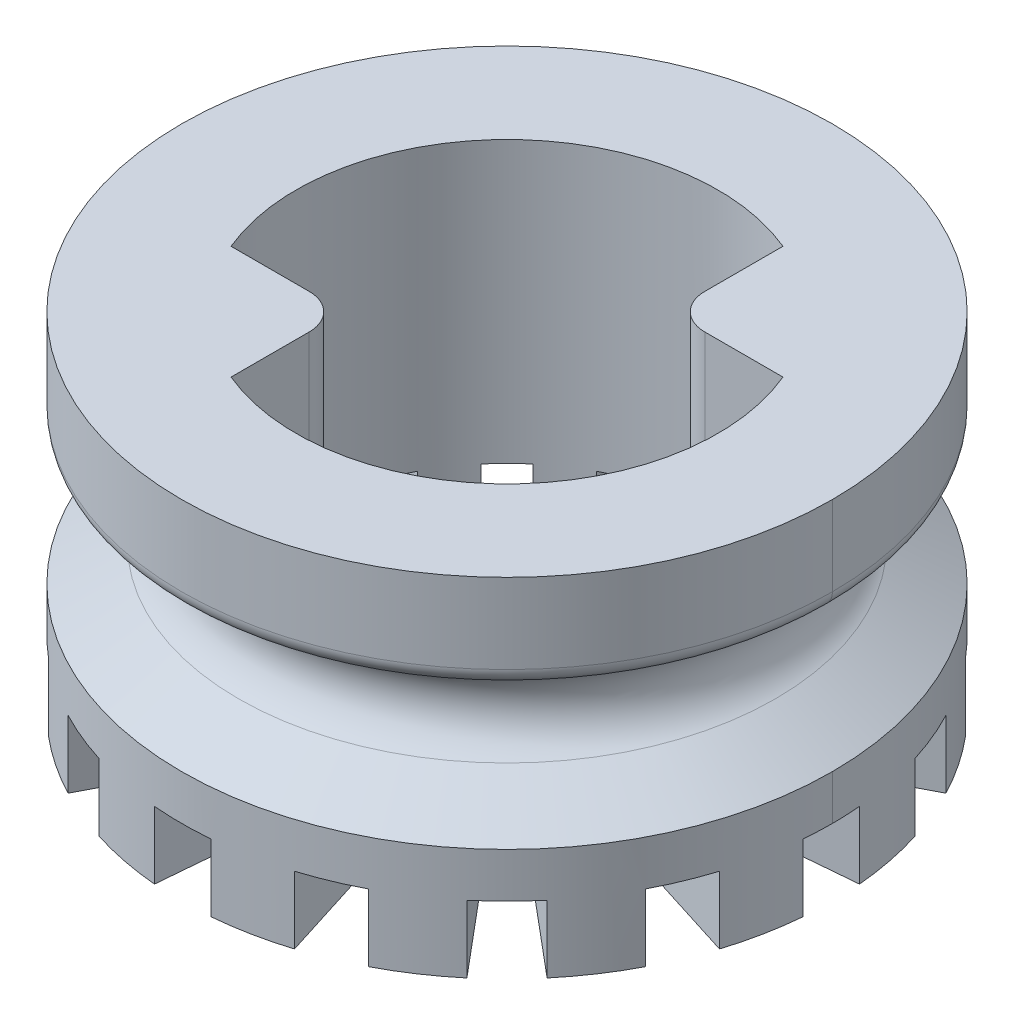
ISO-10303-21;
HEADER;
FILE_DESCRIPTION(('STEP AP214'),'2;1');
FILE_NAME('part.step','',(''),(''),'','','');
FILE_SCHEMA(('AUTOMOTIVE_DESIGN { 1 0 10303 214 1 1 1 1 }'));
ENDSEC;
DATA;
#1=APPLICATION_CONTEXT('core data for automotive mechanical design processes');
#2=APPLICATION_PROTOCOL_DEFINITION('international standard','automotive_design',2000,#1);
#3=PRODUCT_CONTEXT('',#1,'mechanical');
#4=PRODUCT('Part','Part','',(#3));
#5=PRODUCT_RELATED_PRODUCT_CATEGORY('part','',(#4));
#6=PRODUCT_DEFINITION_FORMATION('','',#4);
#7=PRODUCT_DEFINITION_CONTEXT('part definition',#1,'design');
#8=PRODUCT_DEFINITION('design','',#6,#7);
#9=PRODUCT_DEFINITION_SHAPE('','',#8);
#10=(LENGTH_UNIT() NAMED_UNIT(*) SI_UNIT(.MILLI.,.METRE.));
#11=(NAMED_UNIT(*) PLANE_ANGLE_UNIT() SI_UNIT($,.RADIAN.));
#12=(NAMED_UNIT(*) SI_UNIT($,.STERADIAN.) SOLID_ANGLE_UNIT());
#13=UNCERTAINTY_MEASURE_WITH_UNIT(LENGTH_MEASURE(1.E-05),#10,'distance_accuracy_value','');
#14=(GEOMETRIC_REPRESENTATION_CONTEXT(3) GLOBAL_UNCERTAINTY_ASSIGNED_CONTEXT((#13)) GLOBAL_UNIT_ASSIGNED_CONTEXT((#10,
#11,#12)) REPRESENTATION_CONTEXT('',''));
#15=CARTESIAN_POINT('',(0.,0.,0.));
#16=DIRECTION('',(0.,0.,1.));
#17=DIRECTION('',(1.,0.,0.));
#18=AXIS2_PLACEMENT_3D('',#15,#16,#17);
#19=CARTESIAN_POINT('',(0.,0.,0.));
#20=DIRECTION('',(0.,1.,0.));
#21=DIRECTION('',(0.,0.,1.));
#22=AXIS2_PLACEMENT_3D('',#19,#20,#21);
#23=CYLINDRICAL_SURFACE('',#22,2.3876);
#24=DIRECTION('',(0.,1.,0.));
#25=VECTOR('',#24,1.);
#26=CARTESIAN_POINT('',(-2.20291924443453,-1.05126113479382,0.920749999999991));
#27=LINE('',#26,#25);
#28=CARTESIAN_POINT('',(-2.20291924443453,0.761999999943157,0.920749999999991));
#29=VERTEX_POINT('',#28);
#30=CARTESIAN_POINT('',(-2.20291924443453,3.937,0.920749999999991));
#31=VERTEX_POINT('',#30);
#32=EDGE_CURVE('E531',#29,#31,#27,.T.);
#33=ORIENTED_EDGE('',*,*,#32,.F.);
#34=CARTESIAN_POINT('',(0.,0.761999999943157,0.));
#35=DIRECTION('',(0.,-1.,0.));
#36=DIRECTION('',(-0.382683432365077,0.,-0.923879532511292));
#37=AXIS2_PLACEMENT_3D('',#34,#35,#36);
#38=CIRCLE('',#37,2.3876);
#39=CARTESIAN_POINT('',(-2.27709459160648,0.761999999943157,0.717965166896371));
#40=VERTEX_POINT('',#39);
#41=EDGE_CURVE('E517',#29,#40,#38,.T.);
#42=ORIENTED_EDGE('',*,*,#41,.T.);
#43=DIRECTION('',(0.,-1.,0.));
#44=VECTOR('',#43,1.);
#45=CARTESIAN_POINT('',(-2.27709459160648,0.761999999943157,0.717965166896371));
#46=LINE('',#45,#44);
#47=CARTESIAN_POINT('',(-2.27709459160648,-5.6843418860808E-11,0.717965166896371));
#48=VERTEX_POINT('',#47);
#49=EDGE_CURVE('E589',#40,#48,#46,.T.);
#50=ORIENTED_EDGE('',*,*,#49,.T.);
#51=CARTESIAN_POINT('',(0.,0.,0.));
#52=DIRECTION('',(0.,1.,0.));
#53=DIRECTION('',(0.,0.,1.));
#54=AXIS2_PLACEMENT_3D('',#51,#52,#53);
#55=CIRCLE('',#54,2.3876);
#56=CARTESIAN_POINT('',(-2.37851446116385,-5.6843418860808E-11,0.20809305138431));
#57=VERTEX_POINT('',#56);
#58=EDGE_CURVE('E996',#57,#48,#55,.T.);
#59=ORIENTED_EDGE('',*,*,#58,.F.);
#60=DIRECTION('',(0.,-1.,0.));
#61=VECTOR('',#60,1.);
#62=CARTESIAN_POINT('',(-2.37851446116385,0.761999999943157,0.20809305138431));
#63=LINE('',#62,#61);
#64=CARTESIAN_POINT('',(-2.37851446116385,0.761999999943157,0.20809305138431));
#65=VERTEX_POINT('',#64);
#66=EDGE_CURVE('E972',#65,#57,#63,.T.);
#67=ORIENTED_EDGE('',*,*,#66,.F.);
#68=CARTESIAN_POINT('',(0.,0.761999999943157,0.));
#69=DIRECTION('',(0.,-1.,0.));
#70=DIRECTION('',(0.,0.,-1.));
#71=AXIS2_PLACEMENT_3D('',#68,#69,#70);
#72=CIRCLE('',#71,2.3876);
#73=CARTESIAN_POINT('',(-2.37851446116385,0.761999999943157,-0.208093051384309));
#74=VERTEX_POINT('',#73);
#75=EDGE_CURVE('E960',#65,#74,#72,.T.);
#76=ORIENTED_EDGE('',*,*,#75,.T.);
#77=DIRECTION('',(0.,-1.,0.));
#78=VECTOR('',#77,1.);
#79=CARTESIAN_POINT('',(-2.37851446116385,0.761999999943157,-0.208093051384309));
#80=LINE('',#79,#78);
#81=CARTESIAN_POINT('',(-2.37851446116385,-5.6843418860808E-11,-0.208093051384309));
#82=VERTEX_POINT('',#81);
#83=EDGE_CURVE('E980',#74,#82,#80,.T.);
#84=ORIENTED_EDGE('',*,*,#83,.T.);
#85=CARTESIAN_POINT('',(-2.27709459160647,-5.6843418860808E-11,-0.717965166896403));
#86=VERTEX_POINT('',#85);
#87=EDGE_CURVE('E995',#86,#82,#55,.T.);
#88=ORIENTED_EDGE('',*,*,#87,.F.);
#89=DIRECTION('',(0.,-1.,0.));
#90=VECTOR('',#89,1.);
#91=CARTESIAN_POINT('',(-2.27709459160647,0.761999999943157,-0.717965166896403));
#92=LINE('',#91,#90);
#93=CARTESIAN_POINT('',(-2.27709459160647,0.761999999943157,-0.717965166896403));
#94=VERTEX_POINT('',#93);
#95=EDGE_CURVE('E944',#94,#86,#92,.T.);
#96=ORIENTED_EDGE('',*,*,#95,.F.);
#97=CARTESIAN_POINT('',(0.,0.761999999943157,0.));
#98=DIRECTION('',(0.,-1.,0.));
#99=DIRECTION('',(0.382683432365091,0.,-0.923879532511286));
#100=AXIS2_PLACEMENT_3D('',#97,#98,#99);
#101=CIRCLE('',#100,2.3876);
#102=CARTESIAN_POINT('',(-2.11782706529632,0.761999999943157,-1.10247098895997));
#103=VERTEX_POINT('',#102);
#104=EDGE_CURVE('E933',#94,#103,#101,.T.);
#105=ORIENTED_EDGE('',*,*,#104,.T.);
#106=DIRECTION('',(0.,-1.,0.));
#107=VECTOR('',#106,1.);
#108=CARTESIAN_POINT('',(-2.11782706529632,0.761999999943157,-1.10247098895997));
#109=LINE('',#108,#107);
#110=CARTESIAN_POINT('',(-2.11782706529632,-5.6843418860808E-11,-1.10247098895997));
#111=VERTEX_POINT('',#110);
#112=EDGE_CURVE('E952',#103,#111,#109,.T.);
#113=ORIENTED_EDGE('',*,*,#112,.T.);
#114=CARTESIAN_POINT('',(-1.82900771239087,-5.6843418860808E-11,-1.53471969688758));
#115=VERTEX_POINT('',#114);
#116=EDGE_CURVE('E1124',#115,#111,#55,.T.);
#117=ORIENTED_EDGE('',*,*,#116,.F.);
#118=DIRECTION('',(0.,-1.,0.));
#119=VECTOR('',#118,1.);
#120=CARTESIAN_POINT('',(-1.82900771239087,0.761999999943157,-1.53471969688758));
#121=LINE('',#120,#119);
#122=CARTESIAN_POINT('',(-1.82900771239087,0.761999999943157,-1.53471969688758));
#123=VERTEX_POINT('',#122);
#124=EDGE_CURVE('E917',#123,#115,#121,.T.);
#125=ORIENTED_EDGE('',*,*,#124,.F.);
#126=CARTESIAN_POINT('',(0.,0.761999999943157,0.));
#127=DIRECTION('',(0.,-1.,0.));
#128=DIRECTION('',(0.707106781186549,0.,-0.707106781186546));
#129=AXIS2_PLACEMENT_3D('',#126,#127,#128);
#130=CIRCLE('',#129,2.3876);
#131=CARTESIAN_POINT('',(-1.53471969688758,0.761999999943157,-1.82900771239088));
#132=VERTEX_POINT('',#131);
#133=EDGE_CURVE('E906',#123,#132,#130,.T.);
#134=ORIENTED_EDGE('',*,*,#133,.T.);
#135=DIRECTION('',(0.,-1.,0.));
#136=VECTOR('',#135,1.);
#137=CARTESIAN_POINT('',(-1.53471969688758,0.761999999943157,-1.82900771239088));
#138=LINE('',#137,#136);
#139=CARTESIAN_POINT('',(-1.53471969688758,-5.6843418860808E-11,-1.82900771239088));
#140=VERTEX_POINT('',#139);
#141=EDGE_CURVE('E925',#132,#140,#138,.T.);
#142=ORIENTED_EDGE('',*,*,#141,.T.);
#143=CARTESIAN_POINT('',(-1.10247098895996,-5.6843418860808E-11,-2.11782706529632));
#144=VERTEX_POINT('',#143);
#145=EDGE_CURVE('E1125',#144,#140,#55,.T.);
#146=ORIENTED_EDGE('',*,*,#145,.F.);
#147=DIRECTION('',(0.,-1.,0.));
#148=VECTOR('',#147,1.);
#149=CARTESIAN_POINT('',(-1.10247098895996,0.761999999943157,-2.11782706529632));
#150=LINE('',#149,#148);
#151=CARTESIAN_POINT('',(-1.10247098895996,0.761999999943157,-2.11782706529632));
#152=VERTEX_POINT('',#151);
#153=EDGE_CURVE('E890',#152,#144,#150,.T.);
#154=ORIENTED_EDGE('',*,*,#153,.F.);
#155=CARTESIAN_POINT('',(0.,0.761999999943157,0.));
#156=DIRECTION('',(0.,-1.,0.));
#157=DIRECTION('',(0.923879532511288,0.,-0.382683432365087));
#158=AXIS2_PLACEMENT_3D('',#155,#156,#157);
#159=CIRCLE('',#158,2.3876);
#160=CARTESIAN_POINT('',(-0.717965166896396,0.761999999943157,-2.27709459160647));
#161=VERTEX_POINT('',#160);
#162=EDGE_CURVE('E879',#152,#161,#159,.T.);
#163=ORIENTED_EDGE('',*,*,#162,.T.);
#164=DIRECTION('',(0.,-1.,0.));
#165=VECTOR('',#164,1.);
#166=CARTESIAN_POINT('',(-0.717965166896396,0.761999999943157,-2.27709459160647));
#167=LINE('',#166,#165);
#168=CARTESIAN_POINT('',(-0.717965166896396,-5.6843418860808E-11,-2.27709459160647));
#169=VERTEX_POINT('',#168);
#170=EDGE_CURVE('E898',#161,#169,#167,.T.);
#171=ORIENTED_EDGE('',*,*,#170,.T.);
#172=CARTESIAN_POINT('',(-0.208093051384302,-5.6843418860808E-11,-2.37851446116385));
#173=VERTEX_POINT('',#172);
#174=EDGE_CURVE('E1130',#173,#169,#55,.T.);
#175=ORIENTED_EDGE('',*,*,#174,.F.);
#176=DIRECTION('',(0.,-1.,0.));
#177=VECTOR('',#176,1.);
#178=CARTESIAN_POINT('',(-0.208093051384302,0.761999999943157,-2.37851446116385));
#179=LINE('',#178,#177);
#180=CARTESIAN_POINT('',(-0.208093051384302,0.761999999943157,-2.37851446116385));
#181=VERTEX_POINT('',#180);
#182=EDGE_CURVE('E863',#181,#173,#179,.T.);
#183=ORIENTED_EDGE('',*,*,#182,.F.);
#184=CARTESIAN_POINT('',(0.,0.761999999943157,0.));
#185=DIRECTION('',(0.,-1.,0.));
#186=DIRECTION('',(1.,0.,0.));
#187=AXIS2_PLACEMENT_3D('',#184,#185,#186);
#188=CIRCLE('',#187,2.3876);
#189=CARTESIAN_POINT('',(0.208093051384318,0.761999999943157,-2.37851446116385));
#190=VERTEX_POINT('',#189);
#191=EDGE_CURVE('E852',#181,#190,#188,.T.);
#192=ORIENTED_EDGE('',*,*,#191,.T.);
#193=DIRECTION('',(0.,-1.,0.));
#194=VECTOR('',#193,1.);
#195=CARTESIAN_POINT('',(0.208093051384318,0.761999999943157,-2.37851446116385));
#196=LINE('',#195,#194);
#197=CARTESIAN_POINT('',(0.208093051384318,-5.6843418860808E-11,-2.37851446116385));
#198=VERTEX_POINT('',#197);
#199=EDGE_CURVE('E871',#190,#198,#196,.T.);
#200=ORIENTED_EDGE('',*,*,#199,.T.);
#201=CARTESIAN_POINT('',(0.717965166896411,-5.6843418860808E-11,-2.27709459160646));
#202=VERTEX_POINT('',#201);
#203=EDGE_CURVE('E1135',#202,#198,#55,.T.);
#204=ORIENTED_EDGE('',*,*,#203,.F.);
#205=DIRECTION('',(0.,-1.,0.));
#206=VECTOR('',#205,1.);
#207=CARTESIAN_POINT('',(0.717965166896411,0.761999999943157,-2.27709459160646));
#208=LINE('',#207,#206);
#209=CARTESIAN_POINT('',(0.717965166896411,0.761999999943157,-2.27709459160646));
#210=VERTEX_POINT('',#209);
#211=EDGE_CURVE('E836',#210,#202,#208,.T.);
#212=ORIENTED_EDGE('',*,*,#211,.F.);
#213=CARTESIAN_POINT('',(0.,0.761999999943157,0.));
#214=DIRECTION('',(0.,-1.,0.));
#215=DIRECTION('',(0.923879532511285,0.,0.382683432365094));
#216=AXIS2_PLACEMENT_3D('',#213,#214,#215);
#217=CIRCLE('',#216,2.3876);
#218=CARTESIAN_POINT('',(0.92075,0.761999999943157,-2.20291924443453));
#219=VERTEX_POINT('',#218);
#220=EDGE_CURVE('E826',#210,#219,#217,.T.);
#221=ORIENTED_EDGE('',*,*,#220,.T.);
#222=DIRECTION('',(0.,1.,0.));
#223=VECTOR('',#222,1.);
#224=CARTESIAN_POINT('',(0.92075,-1.05126113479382,-2.20291924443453));
#225=LINE('',#224,#223);
#226=CARTESIAN_POINT('',(0.92075,3.937,-2.20291924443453));
#227=VERTEX_POINT('',#226);
#228=EDGE_CURVE('E571',#219,#227,#225,.T.);
#229=ORIENTED_EDGE('',*,*,#228,.T.);
#230=CARTESIAN_POINT('',(0.,3.937,0.));
#231=DIRECTION('',(0.,1.,0.));
#232=DIRECTION('',(0.,0.,1.));
#233=AXIS2_PLACEMENT_3D('',#230,#231,#232);
#234=CIRCLE('',#233,2.3876);
#235=EDGE_CURVE('E533',#227,#31,#234,.T.);
#236=ORIENTED_EDGE('',*,*,#235,.T.);
#237=EDGE_LOOP('',(#33,#42,#50,#59,#67,#76,#84,#88,#96,#105,#113,#117,#125,#134,#142,#146,#154,
#163,#171,#175,#183,#192,#200,#204,#212,#221,#229,#236));
#238=FACE_BOUND('',#237,.T.);
#239=ADVANCED_FACE('F38',(#238),#23,.F.);
#240=DIRECTION('',(0.,1.,0.));
#241=VECTOR('',#240,1.);
#242=CARTESIAN_POINT('',(-0.920750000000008,-1.05126113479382,2.20291924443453));
#243=LINE('',#242,#241);
#244=CARTESIAN_POINT('',(-0.920750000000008,0.761999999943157,2.20291924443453));
#245=VERTEX_POINT('',#244);
#246=CARTESIAN_POINT('',(-0.920750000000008,3.937,2.20291924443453));
#247=VERTEX_POINT('',#246);
#248=EDGE_CURVE('E538',#245,#247,#243,.T.);
#249=ORIENTED_EDGE('',*,*,#248,.T.);
#250=CARTESIAN_POINT('',(2.20291924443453,3.937,-0.92075));
#251=VERTEX_POINT('',#250);
#252=EDGE_CURVE('E993',#247,#251,#234,.T.);
#253=ORIENTED_EDGE('',*,*,#252,.T.);
#254=DIRECTION('',(0.,1.,0.));
#255=VECTOR('',#254,1.);
#256=CARTESIAN_POINT('',(2.20291924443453,-1.05126113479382,-0.92075));
#257=LINE('',#256,#255);
#258=CARTESIAN_POINT('',(2.20291924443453,0.761999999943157,-0.92075));
#259=VERTEX_POINT('',#258);
#260=EDGE_CURVE('E567',#259,#251,#257,.T.);
#261=ORIENTED_EDGE('',*,*,#260,.F.);
#262=CARTESIAN_POINT('',(0.,0.761999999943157,0.));
#263=DIRECTION('',(0.,-1.,0.));
#264=DIRECTION('',(0.382683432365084,0.,0.923879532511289));
#265=AXIS2_PLACEMENT_3D('',#262,#263,#264);
#266=CIRCLE('',#265,2.3876);
#267=CARTESIAN_POINT('',(2.27709459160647,0.761999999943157,-0.717965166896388));
#268=VERTEX_POINT('',#267);
#269=EDGE_CURVE('E776',#259,#268,#266,.T.);
#270=ORIENTED_EDGE('',*,*,#269,.T.);
#271=DIRECTION('',(0.,-1.,0.));
#272=VECTOR('',#271,1.);
#273=CARTESIAN_POINT('',(2.27709459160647,0.761999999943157,-0.717965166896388));
#274=LINE('',#273,#272);
#275=CARTESIAN_POINT('',(2.27709459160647,-5.6843418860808E-11,-0.717965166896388));
#276=VERTEX_POINT('',#275);
#277=EDGE_CURVE('E794',#268,#276,#274,.T.);
#278=ORIENTED_EDGE('',*,*,#277,.T.);
#279=CARTESIAN_POINT('',(2.37851446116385,-5.6843418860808E-11,-0.208093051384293));
#280=VERTEX_POINT('',#279);
#281=EDGE_CURVE('E1150',#280,#276,#55,.T.);
#282=ORIENTED_EDGE('',*,*,#281,.F.);
#283=DIRECTION('',(0.,-1.,0.));
#284=VECTOR('',#283,1.);
#285=CARTESIAN_POINT('',(2.37851446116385,0.761999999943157,-0.208093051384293));
#286=LINE('',#285,#284);
#287=CARTESIAN_POINT('',(2.37851446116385,0.761999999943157,-0.208093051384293));
#288=VERTEX_POINT('',#287);
#289=EDGE_CURVE('E760',#288,#280,#286,.T.);
#290=ORIENTED_EDGE('',*,*,#289,.F.);
#291=CARTESIAN_POINT('',(0.,0.761999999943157,0.));
#292=DIRECTION('',(0.,-1.,0.));
#293=DIRECTION('',(0.,0.,1.));
#294=AXIS2_PLACEMENT_3D('',#291,#292,#293);
#295=CIRCLE('',#294,2.3876);
#296=CARTESIAN_POINT('',(2.37851446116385,0.761999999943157,0.208093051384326));
#297=VERTEX_POINT('',#296);
#298=EDGE_CURVE('E749',#288,#297,#295,.T.);
#299=ORIENTED_EDGE('',*,*,#298,.T.);
#300=DIRECTION('',(0.,-1.,0.));
#301=VECTOR('',#300,1.);
#302=CARTESIAN_POINT('',(2.37851446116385,0.761999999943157,0.208093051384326));
#303=LINE('',#302,#301);
#304=CARTESIAN_POINT('',(2.37851446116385,-5.6843418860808E-11,0.208093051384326));
#305=VERTEX_POINT('',#304);
#306=EDGE_CURVE('E768',#297,#305,#303,.T.);
#307=ORIENTED_EDGE('',*,*,#306,.T.);
#308=CARTESIAN_POINT('',(2.27709459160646,-5.6843418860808E-11,0.717965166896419));
#309=VERTEX_POINT('',#308);
#310=EDGE_CURVE('E1155',#309,#305,#55,.T.);
#311=ORIENTED_EDGE('',*,*,#310,.F.);
#312=DIRECTION('',(0.,-1.,0.));
#313=VECTOR('',#312,1.);
#314=CARTESIAN_POINT('',(2.27709459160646,0.761999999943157,0.717965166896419));
#315=LINE('',#314,#313);
#316=CARTESIAN_POINT('',(2.27709459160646,0.761999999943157,0.717965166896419));
#317=VERTEX_POINT('',#316);
#318=EDGE_CURVE('E733',#317,#309,#315,.T.);
#319=ORIENTED_EDGE('',*,*,#318,.F.);
#320=CARTESIAN_POINT('',(0.,0.761999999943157,0.));
#321=DIRECTION('',(0.,-1.,0.));
#322=DIRECTION('',(-0.382683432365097,0.,0.923879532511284));
#323=AXIS2_PLACEMENT_3D('',#320,#321,#322);
#324=CIRCLE('',#323,2.3876);
#325=CARTESIAN_POINT('',(2.11782706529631,0.761999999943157,1.10247098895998));
#326=VERTEX_POINT('',#325);
#327=EDGE_CURVE('E723',#317,#326,#324,.T.);
#328=ORIENTED_EDGE('',*,*,#327,.T.);
#329=DIRECTION('',(0.,-1.,0.));
#330=VECTOR('',#329,1.);
#331=CARTESIAN_POINT('',(2.11782706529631,0.761999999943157,1.10247098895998));
#332=LINE('',#331,#330);
#333=CARTESIAN_POINT('',(2.11782706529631,-5.6843418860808E-11,1.10247098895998));
#334=VERTEX_POINT('',#333);
#335=EDGE_CURVE('E741',#326,#334,#332,.T.);
#336=ORIENTED_EDGE('',*,*,#335,.T.);
#337=CARTESIAN_POINT('',(1.82900771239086,-5.6843418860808E-11,1.5347196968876));
#338=VERTEX_POINT('',#337);
#339=EDGE_CURVE('E1156',#338,#334,#55,.T.);
#340=ORIENTED_EDGE('',*,*,#339,.F.);
#341=DIRECTION('',(0.,-1.,0.));
#342=VECTOR('',#341,1.);
#343=CARTESIAN_POINT('',(1.82900771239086,0.761999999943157,1.5347196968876));
#344=LINE('',#343,#342);
#345=CARTESIAN_POINT('',(1.82900771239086,0.761999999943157,1.5347196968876));
#346=VERTEX_POINT('',#345);
#347=EDGE_CURVE('E707',#346,#338,#344,.T.);
#348=ORIENTED_EDGE('',*,*,#347,.F.);
#349=CARTESIAN_POINT('',(0.,0.761999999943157,0.));
#350=DIRECTION('',(0.,-1.,0.));
#351=DIRECTION('',(-0.707106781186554,0.,0.707106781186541));
#352=AXIS2_PLACEMENT_3D('',#349,#350,#351);
#353=CIRCLE('',#352,2.3876);
#354=CARTESIAN_POINT('',(1.53471969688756,0.761999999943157,1.82900771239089));
#355=VERTEX_POINT('',#354);
#356=EDGE_CURVE('E697',#346,#355,#353,.T.);
#357=ORIENTED_EDGE('',*,*,#356,.T.);
#358=DIRECTION('',(0.,-1.,0.));
#359=VECTOR('',#358,1.);
#360=CARTESIAN_POINT('',(1.53471969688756,0.761999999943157,1.82900771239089));
#361=LINE('',#360,#359);
#362=CARTESIAN_POINT('',(1.53471969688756,-5.6843418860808E-11,1.82900771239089));
#363=VERTEX_POINT('',#362);
#364=EDGE_CURVE('E715',#355,#363,#361,.T.);
#365=ORIENTED_EDGE('',*,*,#364,.T.);
#366=CARTESIAN_POINT('',(1.10247098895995,-5.6843418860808E-11,2.11782706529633));
#367=VERTEX_POINT('',#366);
#368=EDGE_CURVE('E1159',#367,#363,#55,.T.);
#369=ORIENTED_EDGE('',*,*,#368,.F.);
#370=DIRECTION('',(0.,-1.,0.));
#371=VECTOR('',#370,1.);
#372=CARTESIAN_POINT('',(1.10247098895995,0.761999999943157,2.11782706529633));
#373=LINE('',#372,#371);
#374=CARTESIAN_POINT('',(1.10247098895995,0.761999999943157,2.11782706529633));
#375=VERTEX_POINT('',#374);
#376=EDGE_CURVE('E681',#375,#367,#373,.T.);
#377=ORIENTED_EDGE('',*,*,#376,.F.);
#378=CARTESIAN_POINT('',(0.,0.761999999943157,0.));
#379=DIRECTION('',(0.,-1.,0.));
#380=DIRECTION('',(-0.923879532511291,0.,0.382683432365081));
#381=AXIS2_PLACEMENT_3D('',#378,#379,#380);
#382=CIRCLE('',#381,2.3876);
#383=CARTESIAN_POINT('',(0.717965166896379,0.761999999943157,2.27709459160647));
#384=VERTEX_POINT('',#383);
#385=EDGE_CURVE('E671',#375,#384,#382,.T.);
#386=ORIENTED_EDGE('',*,*,#385,.T.);
#387=DIRECTION('',(0.,-1.,0.));
#388=VECTOR('',#387,1.);
#389=CARTESIAN_POINT('',(0.717965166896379,0.761999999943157,2.27709459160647));
#390=LINE('',#389,#388);
#391=CARTESIAN_POINT('',(0.717965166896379,-5.6843418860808E-11,2.27709459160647));
#392=VERTEX_POINT('',#391);
#393=EDGE_CURVE('E689',#384,#392,#390,.T.);
#394=ORIENTED_EDGE('',*,*,#393,.T.);
#395=CARTESIAN_POINT('',(0.208093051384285,-5.6843418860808E-11,2.37851446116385));
#396=VERTEX_POINT('',#395);
#397=EDGE_CURVE('E1164',#396,#392,#55,.T.);
#398=ORIENTED_EDGE('',*,*,#397,.F.);
#399=DIRECTION('',(0.,-1.,0.));
#400=VECTOR('',#399,1.);
#401=CARTESIAN_POINT('',(0.208093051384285,0.761999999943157,2.37851446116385));
#402=LINE('',#401,#400);
#403=CARTESIAN_POINT('',(0.208093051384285,0.761999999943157,2.37851446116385));
#404=VERTEX_POINT('',#403);
#405=EDGE_CURVE('E655',#404,#396,#402,.T.);
#406=ORIENTED_EDGE('',*,*,#405,.F.);
#407=CARTESIAN_POINT('',(0.,0.761999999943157,0.));
#408=DIRECTION('',(0.,-1.,0.));
#409=DIRECTION('',(-1.,0.,0.));
#410=AXIS2_PLACEMENT_3D('',#407,#408,#409);
#411=CIRCLE('',#410,2.3876);
#412=CARTESIAN_POINT('',(-0.208093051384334,0.761999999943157,2.37851446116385));
#413=VERTEX_POINT('',#412);
#414=EDGE_CURVE('E645',#404,#413,#411,.T.);
#415=ORIENTED_EDGE('',*,*,#414,.T.);
#416=DIRECTION('',(0.,-1.,0.));
#417=VECTOR('',#416,1.);
#418=CARTESIAN_POINT('',(-0.208093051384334,0.761999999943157,2.37851446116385));
#419=LINE('',#418,#417);
#420=CARTESIAN_POINT('',(-0.208093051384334,-5.6843418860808E-11,2.37851446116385));
#421=VERTEX_POINT('',#420);
#422=EDGE_CURVE('E663',#413,#421,#419,.T.);
#423=ORIENTED_EDGE('',*,*,#422,.T.);
#424=CARTESIAN_POINT('',(-0.717965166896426,-5.6843418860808E-11,2.27709459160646));
#425=VERTEX_POINT('',#424);
#426=EDGE_CURVE('E1169',#425,#421,#55,.T.);
#427=ORIENTED_EDGE('',*,*,#426,.F.);
#428=DIRECTION('',(0.,-1.,0.));
#429=VECTOR('',#428,1.);
#430=CARTESIAN_POINT('',(-0.717965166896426,0.761999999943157,2.27709459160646));
#431=LINE('',#430,#429);
#432=CARTESIAN_POINT('',(-0.717965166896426,0.761999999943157,2.27709459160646));
#433=VERTEX_POINT('',#432);
#434=EDGE_CURVE('E629',#433,#425,#431,.T.);
#435=ORIENTED_EDGE('',*,*,#434,.F.);
#436=CARTESIAN_POINT('',(0.,0.761999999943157,0.));
#437=DIRECTION('',(0.,-1.,0.));
#438=DIRECTION('',(-0.923879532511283,0.,-0.3826834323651));
#439=AXIS2_PLACEMENT_3D('',#436,#437,#438);
#440=CIRCLE('',#439,2.3876);
#441=EDGE_CURVE('E619',#433,#245,#440,.T.);
#442=ORIENTED_EDGE('',*,*,#441,.T.);
#443=EDGE_LOOP('',(#249,#253,#261,#270,#278,#282,#290,#299,#307,#311,#319,#328,#336,#340,#348,
#357,#365,#369,#377,#386,#394,#398,#406,#415,#423,#427,#435,#442));
#444=FACE_BOUND('',#443,.T.);
#445=ADVANCED_FACE('F1079',(#444),#23,.F.);
#446=DIRECTION('',(0.,-1.,0.));
#447=VECTOR('',#446,1.);
#448=CARTESIAN_POINT('',(-2.11782706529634,0.761999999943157,1.10247098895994));
#449=LINE('',#448,#447);
#450=CARTESIAN_POINT('',(-2.11782706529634,0.761999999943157,1.10247098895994));
#451=VERTEX_POINT('',#450);
#452=CARTESIAN_POINT('',(-2.11782706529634,-5.6843418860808E-11,1.10247098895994));
#453=VERTEX_POINT('',#452);
#454=EDGE_CURVE('E582',#451,#453,#449,.T.);
#455=ORIENTED_EDGE('',*,*,#454,.F.);
#456=CARTESIAN_POINT('',(0.,0.761999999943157,0.));
#457=DIRECTION('',(0.,-1.,0.));
#458=DIRECTION('',(0.,0.,-1.));
#459=AXIS2_PLACEMENT_3D('',#456,#457,#458);
#460=CIRCLE('',#459,2.3876);
#461=CARTESIAN_POINT('',(-1.82900771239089,0.761999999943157,1.53471969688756));
#462=VERTEX_POINT('',#461);
#463=EDGE_CURVE('E552',#451,#462,#460,.F.);
#464=ORIENTED_EDGE('',*,*,#463,.T.);
#465=DIRECTION('',(0.,-1.,0.));
#466=VECTOR('',#465,1.);
#467=CARTESIAN_POINT('',(-1.82900771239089,0.761999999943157,1.53471969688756));
#468=LINE('',#467,#466);
#469=CARTESIAN_POINT('',(-1.82900771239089,-5.6843418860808E-11,1.53471969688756));
#470=VERTEX_POINT('',#469);
#471=EDGE_CURVE('E611',#462,#470,#468,.T.);
#472=ORIENTED_EDGE('',*,*,#471,.T.);
#473=EDGE_CURVE('E1000',#453,#470,#55,.T.);
#474=ORIENTED_EDGE('',*,*,#473,.F.);
#475=EDGE_LOOP('',(#455,#464,#472,#474));
#476=FACE_BOUND('',#475,.T.);
#477=ADVANCED_FACE('F1195',(#476),#23,.F.);
#478=DIRECTION('',(0.,-1.,0.));
#479=VECTOR('',#478,1.);
#480=CARTESIAN_POINT('',(2.11782706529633,0.761999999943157,-1.10247098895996));
#481=LINE('',#480,#479);
#482=CARTESIAN_POINT('',(2.11782706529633,0.761999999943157,-1.10247098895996));
#483=VERTEX_POINT('',#482);
#484=CARTESIAN_POINT('',(2.11782706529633,-5.6843418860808E-11,-1.10247098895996));
#485=VERTEX_POINT('',#484);
#486=EDGE_CURVE('E786',#483,#485,#481,.T.);
#487=ORIENTED_EDGE('',*,*,#486,.F.);
#488=CARTESIAN_POINT('',(0.,0.761999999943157,0.));
#489=DIRECTION('',(0.,-1.,0.));
#490=DIRECTION('',(0.,0.,-1.));
#491=AXIS2_PLACEMENT_3D('',#488,#489,#490);
#492=CIRCLE('',#491,2.3876);
#493=CARTESIAN_POINT('',(1.82900771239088,0.761999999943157,-1.53471969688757));
#494=VERTEX_POINT('',#493);
#495=EDGE_CURVE('E566',#483,#494,#492,.F.);
#496=ORIENTED_EDGE('',*,*,#495,.T.);
#497=DIRECTION('',(0.,-1.,0.));
#498=VECTOR('',#497,1.);
#499=CARTESIAN_POINT('',(1.82900771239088,0.761999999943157,-1.53471969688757));
#500=LINE('',#499,#498);
#501=CARTESIAN_POINT('',(1.82900771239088,-5.6843418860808E-11,-1.53471969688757));
#502=VERTEX_POINT('',#501);
#503=EDGE_CURVE('E818',#494,#502,#500,.T.);
#504=ORIENTED_EDGE('',*,*,#503,.T.);
#505=EDGE_CURVE('E1145',#485,#502,#55,.T.);
#506=ORIENTED_EDGE('',*,*,#505,.F.);
#507=EDGE_LOOP('',(#487,#496,#504,#506));
#508=FACE_BOUND('',#507,.T.);
#509=ADVANCED_FACE('F1251',(#508),#23,.F.);
#510=DIRECTION('',(0.,-1.,0.));
#511=VECTOR('',#510,1.);
#512=CARTESIAN_POINT('',(1.53471969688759,0.761999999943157,-1.82900771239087));
#513=LINE('',#512,#511);
#514=CARTESIAN_POINT('',(1.53471969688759,0.761999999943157,-1.82900771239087));
#515=VERTEX_POINT('',#514);
#516=CARTESIAN_POINT('',(1.53471969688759,-5.6843418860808E-11,-1.82900771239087));
#517=VERTEX_POINT('',#516);
#518=EDGE_CURVE('E810',#515,#517,#513,.T.);
#519=ORIENTED_EDGE('',*,*,#518,.F.);
#520=CARTESIAN_POINT('',(1.10247098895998,0.761999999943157,-2.11782706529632));
#521=VERTEX_POINT('',#520);
#522=EDGE_CURVE('E564',#515,#521,#492,.F.);
#523=ORIENTED_EDGE('',*,*,#522,.T.);
#524=DIRECTION('',(0.,-1.,0.));
#525=VECTOR('',#524,1.);
#526=CARTESIAN_POINT('',(1.10247098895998,0.761999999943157,-2.11782706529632));
#527=LINE('',#526,#525);
#528=CARTESIAN_POINT('',(1.10247098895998,-5.6843418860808E-11,-2.11782706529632));
#529=VERTEX_POINT('',#528);
#530=EDGE_CURVE('E844',#521,#529,#527,.T.);
#531=ORIENTED_EDGE('',*,*,#530,.T.);
#532=EDGE_CURVE('E1140',#517,#529,#55,.T.);
#533=ORIENTED_EDGE('',*,*,#532,.F.);
#534=EDGE_LOOP('',(#519,#523,#531,#533));
#535=FACE_BOUND('',#534,.T.);
#536=ADVANCED_FACE('F1243',(#535),#23,.F.);
#537=CARTESIAN_POINT('',(0.,0.,0.));
#538=DIRECTION('',(0.,1.,0.));
#539=DIRECTION('',(0.,0.,1.));
#540=AXIS2_PLACEMENT_3D('',#537,#538,#539);
#541=PLANE('',#540);
#542=DIRECTION('',(-0.953716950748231,0.,0.30070579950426));
#543=VECTOR('',#542,1.);
#544=CARTESIAN_POINT('',(-2.27709459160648,-5.6843418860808E-11,0.717965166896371));
#545=LINE('',#544,#543);
#546=CARTESIAN_POINT('',(-3.51253952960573,-5.6843418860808E-11,1.10749945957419));
#547=VERTEX_POINT('',#546);
#548=EDGE_CURVE('E573',#48,#547,#545,.T.);
#549=ORIENTED_EDGE('',*,*,#548,.T.);
#550=CARTESIAN_POINT('',(0.,0.,0.));
#551=DIRECTION('',(0.,1.,0.));
#552=DIRECTION('',(0.,0.,1.));
#553=AXIS2_PLACEMENT_3D('',#550,#551,#552);
#554=CIRCLE('',#553,3.683);
#555=CARTESIAN_POINT('',(-3.6689850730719,-5.6843418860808E-11,0.320994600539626));
#556=VERTEX_POINT('',#555);
#557=EDGE_CURVE('E1001',#556,#547,#554,.T.);
#558=ORIENTED_EDGE('',*,*,#557,.F.);
#559=DIRECTION('',(-0.996194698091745,0.,0.0871557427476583));
#560=VECTOR('',#559,1.);
#561=CARTESIAN_POINT('',(-2.37851446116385,-5.6843418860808E-11,0.20809305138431));
#562=LINE('',#561,#560);
#563=EDGE_CURVE('E958',#57,#556,#562,.T.);
#564=ORIENTED_EDGE('',*,*,#563,.F.);
#565=ORIENTED_EDGE('',*,*,#58,.T.);
#566=EDGE_LOOP('',(#549,#558,#564,#565));
#567=FACE_BOUND('',#566,.T.);
#568=ADVANCED_FACE('F1241',(#567),#541,.F.);
#569=DIRECTION('',(0.,-1.,0.));
#570=VECTOR('',#569,1.);
#571=CARTESIAN_POINT('',(-1.5347196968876,0.761999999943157,1.82900771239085));
#572=LINE('',#571,#570);
#573=CARTESIAN_POINT('',(-1.5347196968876,0.761999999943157,1.82900771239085));
#574=VERTEX_POINT('',#573);
#575=CARTESIAN_POINT('',(-1.5347196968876,-5.6843418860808E-11,1.82900771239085));
#576=VERTEX_POINT('',#575);
#577=EDGE_CURVE('E603',#574,#576,#572,.T.);
#578=ORIENTED_EDGE('',*,*,#577,.F.);
#579=CARTESIAN_POINT('',(-1.10247098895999,0.761999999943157,2.11782706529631));
#580=VERTEX_POINT('',#579);
#581=EDGE_CURVE('E551',#574,#580,#460,.F.);
#582=ORIENTED_EDGE('',*,*,#581,.T.);
#583=DIRECTION('',(0.,-1.,0.));
#584=VECTOR('',#583,1.);
#585=CARTESIAN_POINT('',(-1.10247098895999,0.761999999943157,2.11782706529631));
#586=LINE('',#585,#584);
#587=CARTESIAN_POINT('',(-1.10247098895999,-5.6843418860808E-11,2.11782706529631));
#588=VERTEX_POINT('',#587);
#589=EDGE_CURVE('E637',#580,#588,#586,.T.);
#590=ORIENTED_EDGE('',*,*,#589,.T.);
#591=EDGE_CURVE('E1174',#576,#588,#55,.T.);
#592=ORIENTED_EDGE('',*,*,#591,.F.);
#593=EDGE_LOOP('',(#578,#582,#590,#592));
#594=FACE_BOUND('',#593,.T.);
#595=ADVANCED_FACE('F1235',(#594),#23,.F.);
#596=CARTESIAN_POINT('',(0.,3.937,0.));
#597=DIRECTION('',(0.,-1.,0.));
#598=DIRECTION('',(0.,0.,-1.));
#599=AXIS2_PLACEMENT_3D('',#596,#597,#598);
#600=CYLINDRICAL_SURFACE('',#599,3.683);
#601=DIRECTION('',(0.,-1.,0.));
#602=VECTOR('',#601,1.);
#603=CARTESIAN_POINT('',(-3.51253952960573,0.761999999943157,1.10749945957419));
#604=LINE('',#603,#602);
#605=CARTESIAN_POINT('',(-3.51253952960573,0.761999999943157,1.10749945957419));
#606=VERTEX_POINT('',#605);
#607=EDGE_CURVE('E587',#606,#547,#604,.T.);
#608=ORIENTED_EDGE('',*,*,#607,.F.);
#609=CARTESIAN_POINT('',(0.,0.761999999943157,0.));
#610=DIRECTION('',(0.,-1.,0.));
#611=DIRECTION('',(-0.382683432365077,0.,-0.923879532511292));
#612=AXIS2_PLACEMENT_3D('',#609,#610,#611);
#613=CIRCLE('',#612,3.683);
#614=CARTESIAN_POINT('',(-3.26686089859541,0.761999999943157,1.70062014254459));
#615=VERTEX_POINT('',#614);
#616=EDGE_CURVE('E578',#615,#606,#613,.T.);
#617=ORIENTED_EDGE('',*,*,#616,.F.);
#618=DIRECTION('',(0.,-1.,0.));
#619=VECTOR('',#618,1.);
#620=CARTESIAN_POINT('',(-3.26686089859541,0.761999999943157,1.70062014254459));
#621=LINE('',#620,#619);
#622=CARTESIAN_POINT('',(-3.26686089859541,-5.6843418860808E-11,1.70062014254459));
#623=VERTEX_POINT('',#622);
#624=EDGE_CURVE('E584',#615,#623,#621,.T.);
#625=ORIENTED_EDGE('',*,*,#624,.T.);
#626=CARTESIAN_POINT('',(-2.82134168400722,-5.6843418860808E-11,2.36738676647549));
#627=VERTEX_POINT('',#626);
#628=EDGE_CURVE('E1005',#623,#627,#554,.T.);
#629=ORIENTED_EDGE('',*,*,#628,.T.);
#630=DIRECTION('',(0.,-1.,0.));
#631=VECTOR('',#630,1.);
#632=CARTESIAN_POINT('',(-2.82134168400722,0.761999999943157,2.36738676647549));
#633=LINE('',#632,#631);
#634=CARTESIAN_POINT('',(-2.82134168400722,0.761999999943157,2.36738676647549));
#635=VERTEX_POINT('',#634);
#636=EDGE_CURVE('E608',#635,#627,#633,.T.);
#637=ORIENTED_EDGE('',*,*,#636,.F.);
#638=CARTESIAN_POINT('',(0.,0.761999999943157,0.));
#639=DIRECTION('',(0.,-1.,0.));
#640=DIRECTION('',(-0.707106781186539,0.,-0.707106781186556));
#641=AXIS2_PLACEMENT_3D('',#638,#639,#640);
#642=CIRCLE('',#641,3.683);
#643=CARTESIAN_POINT('',(-2.36738676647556,0.761999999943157,2.82134168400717));
#644=VERTEX_POINT('',#643);
#645=EDGE_CURVE('E598',#644,#635,#642,.T.);
#646=ORIENTED_EDGE('',*,*,#645,.F.);
#647=DIRECTION('',(0.,-1.,0.));
#648=VECTOR('',#647,1.);
#649=CARTESIAN_POINT('',(-2.36738676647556,0.761999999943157,2.82134168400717));
#650=LINE('',#649,#648);
#651=CARTESIAN_POINT('',(-2.36738676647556,-5.6843418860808E-11,2.82134168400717));
#652=VERTEX_POINT('',#651);
#653=EDGE_CURVE('E605',#644,#652,#650,.T.);
#654=ORIENTED_EDGE('',*,*,#653,.T.);
#655=CARTESIAN_POINT('',(-1.70062014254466,-5.6843418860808E-11,3.26686089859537));
#656=VERTEX_POINT('',#655);
#657=EDGE_CURVE('E1203',#652,#656,#554,.T.);
#658=ORIENTED_EDGE('',*,*,#657,.T.);
#659=DIRECTION('',(0.,-1.,0.));
#660=VECTOR('',#659,1.);
#661=CARTESIAN_POINT('',(-1.70062014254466,0.761999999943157,3.26686089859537));
#662=LINE('',#661,#660);
#663=CARTESIAN_POINT('',(-1.70062014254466,0.761999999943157,3.26686089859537));
#664=VERTEX_POINT('',#663);
#665=EDGE_CURVE('E634',#664,#656,#662,.T.);
#666=ORIENTED_EDGE('',*,*,#665,.F.);
#667=CARTESIAN_POINT('',(0.,0.761999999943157,0.));
#668=DIRECTION('',(0.,-1.,0.));
#669=DIRECTION('',(-0.923879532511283,0.,-0.3826834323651));
#670=AXIS2_PLACEMENT_3D('',#667,#668,#669);
#671=CIRCLE('',#670,3.683);
#672=CARTESIAN_POINT('',(-1.10749945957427,0.761999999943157,3.51253952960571));
#673=VERTEX_POINT('',#672);
#674=EDGE_CURVE('E624',#673,#664,#671,.T.);
#675=ORIENTED_EDGE('',*,*,#674,.F.);
#676=DIRECTION('',(0.,-1.,0.));
#677=VECTOR('',#676,1.);
#678=CARTESIAN_POINT('',(-1.10749945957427,0.761999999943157,3.51253952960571));
#679=LINE('',#678,#677);
#680=CARTESIAN_POINT('',(-1.10749945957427,-5.6843418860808E-11,3.51253952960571));
#681=VERTEX_POINT('',#680);
#682=EDGE_CURVE('E631',#673,#681,#679,.T.);
#683=ORIENTED_EDGE('',*,*,#682,.T.);
#684=CARTESIAN_POINT('',(-0.320994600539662,-5.6843418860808E-11,3.6689850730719));
#685=VERTEX_POINT('',#684);
#686=EDGE_CURVE('E1204',#681,#685,#554,.T.);
#687=ORIENTED_EDGE('',*,*,#686,.T.);
#688=DIRECTION('',(0.,-1.,0.));
#689=VECTOR('',#688,1.);
#690=CARTESIAN_POINT('',(-0.320994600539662,0.761999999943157,3.6689850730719));
#691=LINE('',#690,#689);
#692=CARTESIAN_POINT('',(-0.320994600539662,0.761999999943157,3.6689850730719));
#693=VERTEX_POINT('',#692);
#694=EDGE_CURVE('E660',#693,#685,#691,.T.);
#695=ORIENTED_EDGE('',*,*,#694,.F.);
#696=CARTESIAN_POINT('',(0.,0.761999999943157,0.));
#697=DIRECTION('',(0.,-1.,0.));
#698=DIRECTION('',(-1.,0.,0.));
#699=AXIS2_PLACEMENT_3D('',#696,#697,#698);
#700=CIRCLE('',#699,3.683);
#701=CARTESIAN_POINT('',(0.320994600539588,0.761999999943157,3.6689850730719));
#702=VERTEX_POINT('',#701);
#703=EDGE_CURVE('E650',#702,#693,#700,.T.);
#704=ORIENTED_EDGE('',*,*,#703,.F.);
#705=DIRECTION('',(0.,-1.,0.));
#706=VECTOR('',#705,1.);
#707=CARTESIAN_POINT('',(0.320994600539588,0.761999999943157,3.6689850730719));
#708=LINE('',#707,#706);
#709=CARTESIAN_POINT('',(0.320994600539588,-5.6843418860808E-11,3.6689850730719));
#710=VERTEX_POINT('',#709);
#711=EDGE_CURVE('E657',#702,#710,#708,.T.);
#712=ORIENTED_EDGE('',*,*,#711,.T.);
#713=CARTESIAN_POINT('',(1.1074994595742,-5.6843418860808E-11,3.51253952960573));
#714=VERTEX_POINT('',#713);
#715=EDGE_CURVE('E1207',#710,#714,#554,.T.);
#716=ORIENTED_EDGE('',*,*,#715,.T.);
#717=DIRECTION('',(0.,-1.,0.));
#718=VECTOR('',#717,1.);
#719=CARTESIAN_POINT('',(1.1074994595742,0.761999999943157,3.51253952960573));
#720=LINE('',#719,#718);
#721=CARTESIAN_POINT('',(1.1074994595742,0.761999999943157,3.51253952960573));
#722=VERTEX_POINT('',#721);
#723=EDGE_CURVE('E686',#722,#714,#720,.T.);
#724=ORIENTED_EDGE('',*,*,#723,.F.);
#725=CARTESIAN_POINT('',(0.,0.761999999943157,0.));
#726=DIRECTION('',(0.,-1.,0.));
#727=DIRECTION('',(-0.923879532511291,0.,0.382683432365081));
#728=AXIS2_PLACEMENT_3D('',#725,#726,#727);
#729=CIRCLE('',#728,3.683);
#730=CARTESIAN_POINT('',(1.7006201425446,0.761999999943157,3.26686089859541));
#731=VERTEX_POINT('',#730);
#732=EDGE_CURVE('E676',#731,#722,#729,.T.);
#733=ORIENTED_EDGE('',*,*,#732,.F.);
#734=DIRECTION('',(0.,-1.,0.));
#735=VECTOR('',#734,1.);
#736=CARTESIAN_POINT('',(1.7006201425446,0.761999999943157,3.26686089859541));
#737=LINE('',#736,#735);
#738=CARTESIAN_POINT('',(1.7006201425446,-5.6843418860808E-11,3.26686089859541));
#739=VERTEX_POINT('',#738);
#740=EDGE_CURVE('E683',#731,#739,#737,.T.);
#741=ORIENTED_EDGE('',*,*,#740,.T.);
#742=CARTESIAN_POINT('',(2.3673867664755,-5.6843418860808E-11,2.82134168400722));
#743=VERTEX_POINT('',#742);
#744=EDGE_CURVE('E1210',#739,#743,#554,.T.);
#745=ORIENTED_EDGE('',*,*,#744,.T.);
#746=DIRECTION('',(0.,-1.,0.));
#747=VECTOR('',#746,1.);
#748=CARTESIAN_POINT('',(2.3673867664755,0.761999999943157,2.82134168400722));
#749=LINE('',#748,#747);
#750=CARTESIAN_POINT('',(2.3673867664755,0.761999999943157,2.82134168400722));
#751=VERTEX_POINT('',#750);
#752=EDGE_CURVE('E712',#751,#743,#749,.T.);
#753=ORIENTED_EDGE('',*,*,#752,.F.);
#754=CARTESIAN_POINT('',(0.,0.761999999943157,0.));
#755=DIRECTION('',(0.,-1.,0.));
#756=DIRECTION('',(-0.707106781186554,0.,0.707106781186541));
#757=AXIS2_PLACEMENT_3D('',#754,#755,#756);
#758=CIRCLE('',#757,3.683);
#759=CARTESIAN_POINT('',(2.82134168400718,0.761999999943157,2.36738676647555));
#760=VERTEX_POINT('',#759);
#761=EDGE_CURVE('E702',#760,#751,#758,.T.);
#762=ORIENTED_EDGE('',*,*,#761,.F.);
#763=DIRECTION('',(0.,-1.,0.));
#764=VECTOR('',#763,1.);
#765=CARTESIAN_POINT('',(2.82134168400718,0.761999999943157,2.36738676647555));
#766=LINE('',#765,#764);
#767=CARTESIAN_POINT('',(2.82134168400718,-5.6843418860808E-11,2.36738676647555));
#768=VERTEX_POINT('',#767);
#769=EDGE_CURVE('E709',#760,#768,#766,.T.);
#770=ORIENTED_EDGE('',*,*,#769,.T.);
#771=CARTESIAN_POINT('',(3.26686089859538,-5.6843418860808E-11,1.70062014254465));
#772=VERTEX_POINT('',#771);
#773=EDGE_CURVE('E1093',#768,#772,#554,.T.);
#774=ORIENTED_EDGE('',*,*,#773,.T.);
#775=DIRECTION('',(0.,-1.,0.));
#776=VECTOR('',#775,1.);
#777=CARTESIAN_POINT('',(3.26686089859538,0.761999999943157,1.70062014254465));
#778=LINE('',#777,#776);
#779=CARTESIAN_POINT('',(3.26686089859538,0.761999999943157,1.70062014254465));
#780=VERTEX_POINT('',#779);
#781=EDGE_CURVE('E738',#780,#772,#778,.T.);
#782=ORIENTED_EDGE('',*,*,#781,.F.);
#783=CARTESIAN_POINT('',(0.,0.761999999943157,0.));
#784=DIRECTION('',(0.,-1.,0.));
#785=DIRECTION('',(-0.382683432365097,0.,0.923879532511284));
#786=AXIS2_PLACEMENT_3D('',#783,#784,#785);
#787=CIRCLE('',#786,3.683);
#788=CARTESIAN_POINT('',(3.51253952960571,0.761999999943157,1.10749945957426));
#789=VERTEX_POINT('',#788);
#790=EDGE_CURVE('E728',#789,#780,#787,.T.);
#791=ORIENTED_EDGE('',*,*,#790,.F.);
#792=DIRECTION('',(0.,-1.,0.));
#793=VECTOR('',#792,1.);
#794=CARTESIAN_POINT('',(3.51253952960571,0.761999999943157,1.10749945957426));
#795=LINE('',#794,#793);
#796=CARTESIAN_POINT('',(3.51253952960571,-5.6843418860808E-11,1.10749945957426));
#797=VERTEX_POINT('',#796);
#798=EDGE_CURVE('E735',#789,#797,#795,.T.);
#799=ORIENTED_EDGE('',*,*,#798,.T.);
#800=CARTESIAN_POINT('',(3.6689850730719,-5.6843418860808E-11,0.32099460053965));
#801=VERTEX_POINT('',#800);
#802=EDGE_CURVE('E1091',#797,#801,#554,.T.);
#803=ORIENTED_EDGE('',*,*,#802,.T.);
#804=DIRECTION('',(0.,-1.,0.));
#805=VECTOR('',#804,1.);
#806=CARTESIAN_POINT('',(3.6689850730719,0.761999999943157,0.32099460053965));
#807=LINE('',#806,#805);
#808=CARTESIAN_POINT('',(3.6689850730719,0.761999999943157,0.32099460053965));
#809=VERTEX_POINT('',#808);
#810=EDGE_CURVE('E765',#809,#801,#807,.T.);
#811=ORIENTED_EDGE('',*,*,#810,.F.);
#812=CARTESIAN_POINT('',(0.,0.761999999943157,0.));
#813=DIRECTION('',(0.,-1.,0.));
#814=DIRECTION('',(0.,0.,-1.));
#815=AXIS2_PLACEMENT_3D('',#812,#813,#814);
#816=CIRCLE('',#815,3.683);
#817=CARTESIAN_POINT('',(3.683,0.761999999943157,0.));
#818=VERTEX_POINT('',#817);
#819=EDGE_CURVE('E1017',#818,#809,#816,.T.);
#820=ORIENTED_EDGE('',*,*,#819,.F.);
#821=DIRECTION('',(0.,-1.,0.));
#822=VECTOR('',#821,1.);
#823=CARTESIAN_POINT('',(3.683,3.937,0.));
#824=LINE('',#823,#822);
#825=CARTESIAN_POINT('',(3.683,1.27,0.));
#826=VERTEX_POINT('',#825);
#827=EDGE_CURVE('E1013',#826,#818,#824,.T.);
#828=ORIENTED_EDGE('',*,*,#827,.F.);
#829=CARTESIAN_POINT('',(0.,1.27,0.));
#830=DIRECTION('',(0.,-1.,0.));
#831=DIRECTION('',(0.,0.,-1.));
#832=AXIS2_PLACEMENT_3D('',#829,#830,#831);
#833=CIRCLE('',#832,3.683);
#834=CARTESIAN_POINT('',(-3.683,1.27,0.));
#835=VERTEX_POINT('',#834);
#836=EDGE_CURVE('E984',#826,#835,#833,.T.);
#837=ORIENTED_EDGE('',*,*,#836,.T.);
#838=DIRECTION('',(0.,1.,0.));
#839=VECTOR('',#838,1.);
#840=CARTESIAN_POINT('',(-3.683,3.937,0.));
#841=LINE('',#840,#839);
#842=CARTESIAN_POINT('',(-3.683,0.761999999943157,0.));
#843=VERTEX_POINT('',#842);
#844=EDGE_CURVE('E1010',#843,#835,#841,.T.);
#845=ORIENTED_EDGE('',*,*,#844,.F.);
#846=CARTESIAN_POINT('',(0.,0.761999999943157,0.));
#847=DIRECTION('',(0.,-1.,0.));
#848=DIRECTION('',(0.,0.,-1.));
#849=AXIS2_PLACEMENT_3D('',#846,#847,#848);
#850=CIRCLE('',#849,3.683);
#851=CARTESIAN_POINT('',(-3.6689850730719,0.761999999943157,0.320994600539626));
#852=VERTEX_POINT('',#851);
#853=EDGE_CURVE('E967',#852,#843,#850,.T.);
#854=ORIENTED_EDGE('',*,*,#853,.F.);
#855=DIRECTION('',(0.,-1.,0.));
#856=VECTOR('',#855,1.);
#857=CARTESIAN_POINT('',(-3.6689850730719,0.761999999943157,0.320994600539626));
#858=LINE('',#857,#856);
#859=EDGE_CURVE('E974',#852,#556,#858,.T.);
#860=ORIENTED_EDGE('',*,*,#859,.T.);
#861=ORIENTED_EDGE('',*,*,#557,.T.);
#862=EDGE_LOOP('',(#608,#617,#625,#629,#637,#646,#654,#658,#666,#675,#683,#687,#695,#704,#712,
#716,#724,#733,#741,#745,#753,#762,#770,#774,#782,#791,#799,#803,#811,#820,#828,#837,#845,#854,
#860,#861));
#863=FACE_BOUND('',#862,.T.);
#864=ADVANCED_FACE('F1067',(#863),#600,.T.);
#865=ORIENTED_EDGE('',*,*,#628,.F.);
#866=DIRECTION('',(-0.887010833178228,0.,0.461748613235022));
#867=VECTOR('',#866,1.);
#868=CARTESIAN_POINT('',(-2.11782706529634,-5.6843418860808E-11,1.10247098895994));
#869=LINE('',#868,#867);
#870=EDGE_CURVE('E528',#453,#623,#869,.T.);
#871=ORIENTED_EDGE('',*,*,#870,.F.);
#872=ORIENTED_EDGE('',*,*,#473,.T.);
#873=DIRECTION('',(-0.766044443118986,0.,0.64278760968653));
#874=VECTOR('',#873,1.);
#875=CARTESIAN_POINT('',(-1.82900771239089,-5.6843418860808E-11,1.53471969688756));
#876=LINE('',#875,#874);
#877=EDGE_CURVE('E591',#470,#627,#876,.T.);
#878=ORIENTED_EDGE('',*,*,#877,.T.);
#879=EDGE_LOOP('',(#865,#871,#872,#878));
#880=FACE_BOUND('',#879,.T.);
#881=ADVANCED_FACE('F1188',(#880),#541,.F.);
#882=ORIENTED_EDGE('',*,*,#657,.F.);
#883=DIRECTION('',(-0.642787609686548,0.,0.76604444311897));
#884=VECTOR('',#883,1.);
#885=CARTESIAN_POINT('',(-1.5347196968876,-5.6843418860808E-11,1.82900771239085));
#886=LINE('',#885,#884);
#887=EDGE_CURVE('E594',#576,#652,#886,.T.);
#888=ORIENTED_EDGE('',*,*,#887,.F.);
#889=ORIENTED_EDGE('',*,*,#591,.T.);
#890=DIRECTION('',(-0.461748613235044,0.,0.887010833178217));
#891=VECTOR('',#890,1.);
#892=CARTESIAN_POINT('',(-1.10247098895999,-5.6843418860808E-11,2.11782706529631));
#893=LINE('',#892,#891);
#894=EDGE_CURVE('E614',#588,#656,#893,.T.);
#895=ORIENTED_EDGE('',*,*,#894,.T.);
#896=EDGE_LOOP('',(#882,#888,#889,#895));
#897=FACE_BOUND('',#896,.T.);
#898=ADVANCED_FACE('F1804',(#897),#541,.F.);
#899=ORIENTED_EDGE('',*,*,#686,.F.);
#900=DIRECTION('',(-0.300705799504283,0.,0.953716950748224));
#901=VECTOR('',#900,1.);
#902=CARTESIAN_POINT('',(-0.717965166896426,-5.6843418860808E-11,2.27709459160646));
#903=LINE('',#902,#901);
#904=EDGE_CURVE('E617',#425,#681,#903,.T.);
#905=ORIENTED_EDGE('',*,*,#904,.F.);
#906=ORIENTED_EDGE('',*,*,#426,.T.);
#907=DIRECTION('',(-0.0871557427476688,0.,0.996194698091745));
#908=VECTOR('',#907,1.);
#909=CARTESIAN_POINT('',(-0.208093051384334,-5.6843418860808E-11,2.37851446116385));
#910=LINE('',#909,#908);
#911=EDGE_CURVE('E640',#421,#685,#910,.T.);
#912=ORIENTED_EDGE('',*,*,#911,.T.);
#913=EDGE_LOOP('',(#899,#905,#906,#912));
#914=FACE_BOUND('',#913,.T.);
#915=ADVANCED_FACE('F1797',(#914),#541,.F.);
#916=ORIENTED_EDGE('',*,*,#715,.F.);
#917=DIRECTION('',(0.0871557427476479,0.,0.996194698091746));
#918=VECTOR('',#917,1.);
#919=CARTESIAN_POINT('',(0.208093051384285,-5.6843418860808E-11,2.37851446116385));
#920=LINE('',#919,#918);
#921=EDGE_CURVE('E643',#396,#710,#920,.T.);
#922=ORIENTED_EDGE('',*,*,#921,.F.);
#923=ORIENTED_EDGE('',*,*,#397,.T.);
#924=DIRECTION('',(0.300705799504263,0.,0.95371695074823));
#925=VECTOR('',#924,1.);
#926=CARTESIAN_POINT('',(0.717965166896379,-5.6843418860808E-11,2.27709459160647));
#927=LINE('',#926,#925);
#928=EDGE_CURVE('E666',#392,#714,#927,.T.);
#929=ORIENTED_EDGE('',*,*,#928,.T.);
#930=EDGE_LOOP('',(#916,#922,#923,#929));
#931=FACE_BOUND('',#930,.T.);
#932=ADVANCED_FACE('F1232',(#931),#541,.F.);
#933=ORIENTED_EDGE('',*,*,#744,.F.);
#934=DIRECTION('',(0.461748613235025,0.,0.887010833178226));
#935=VECTOR('',#934,1.);
#936=CARTESIAN_POINT('',(1.10247098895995,-5.6843418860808E-11,2.11782706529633));
#937=LINE('',#936,#935);
#938=EDGE_CURVE('E669',#367,#739,#937,.T.);
#939=ORIENTED_EDGE('',*,*,#938,.F.);
#940=ORIENTED_EDGE('',*,*,#368,.T.);
#941=DIRECTION('',(0.642787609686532,0.,0.766044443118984));
#942=VECTOR('',#941,1.);
#943=CARTESIAN_POINT('',(1.53471969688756,-5.6843418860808E-11,1.82900771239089));
#944=LINE('',#943,#942);
#945=EDGE_CURVE('E692',#363,#743,#944,.T.);
#946=ORIENTED_EDGE('',*,*,#945,.T.);
#947=EDGE_LOOP('',(#933,#939,#940,#946));
#948=FACE_BOUND('',#947,.T.);
#949=ADVANCED_FACE('F1226',(#948),#541,.F.);
#950=ORIENTED_EDGE('',*,*,#773,.F.);
#951=DIRECTION('',(0.766044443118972,0.,0.642787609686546));
#952=VECTOR('',#951,1.);
#953=CARTESIAN_POINT('',(1.82900771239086,-5.6843418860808E-11,1.5347196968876));
#954=LINE('',#953,#952);
#955=EDGE_CURVE('E695',#338,#768,#954,.T.);
#956=ORIENTED_EDGE('',*,*,#955,.F.);
#957=ORIENTED_EDGE('',*,*,#339,.T.);
#958=DIRECTION('',(0.887010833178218,0.,0.461748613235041));
#959=VECTOR('',#958,1.);
#960=CARTESIAN_POINT('',(2.11782706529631,-5.6843418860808E-11,1.10247098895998));
#961=LINE('',#960,#959);
#962=EDGE_CURVE('E718',#334,#772,#961,.T.);
#963=ORIENTED_EDGE('',*,*,#962,.T.);
#964=EDGE_LOOP('',(#950,#956,#957,#963));
#965=FACE_BOUND('',#964,.T.);
#966=ADVANCED_FACE('F1223',(#965),#541,.F.);
#967=ORIENTED_EDGE('',*,*,#802,.F.);
#968=DIRECTION('',(0.953716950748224,0.,0.30070579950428));
#969=VECTOR('',#968,1.);
#970=CARTESIAN_POINT('',(2.27709459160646,-5.6843418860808E-11,0.717965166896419));
#971=LINE('',#970,#969);
#972=EDGE_CURVE('E721',#309,#797,#971,.T.);
#973=ORIENTED_EDGE('',*,*,#972,.F.);
#974=ORIENTED_EDGE('',*,*,#310,.T.);
#975=DIRECTION('',(0.996194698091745,0.,0.0871557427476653));
#976=VECTOR('',#975,1.);
#977=CARTESIAN_POINT('',(2.37851446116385,-5.6843418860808E-11,0.208093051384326));
#978=LINE('',#977,#976);
#979=EDGE_CURVE('E744',#305,#801,#978,.T.);
#980=ORIENTED_EDGE('',*,*,#979,.T.);
#981=EDGE_LOOP('',(#967,#973,#974,#980));
#982=FACE_BOUND('',#981,.T.);
#983=ADVANCED_FACE('F1225',(#982),#541,.F.);
#984=CARTESIAN_POINT('',(0.,0.761999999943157,0.));
#985=DIRECTION('',(0.,-1.,0.));
#986=DIRECTION('',(0.,0.,1.));
#987=AXIS2_PLACEMENT_3D('',#984,#985,#986);
#988=CIRCLE('',#987,3.683);
#989=CARTESIAN_POINT('',(3.6689850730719,0.761999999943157,-0.320994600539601));
#990=VERTEX_POINT('',#989);
#991=EDGE_CURVE('E755',#990,#818,#988,.T.);
#992=ORIENTED_EDGE('',*,*,#991,.F.);
#993=DIRECTION('',(0.,-1.,0.));
#994=VECTOR('',#993,1.);
#995=CARTESIAN_POINT('',(3.6689850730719,0.761999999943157,-0.320994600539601));
#996=LINE('',#995,#994);
#997=CARTESIAN_POINT('',(3.6689850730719,-5.6843418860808E-11,-0.320994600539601));
#998=VERTEX_POINT('',#997);
#999=EDGE_CURVE('E762',#990,#998,#996,.T.);
#1000=ORIENTED_EDGE('',*,*,#999,.T.);
#1001=CARTESIAN_POINT('',(3.51253952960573,-5.6843418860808E-11,-1.10749945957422));
#1002=VERTEX_POINT('',#1001);
#1003=EDGE_CURVE('E1087',#998,#1002,#554,.T.);
#1004=ORIENTED_EDGE('',*,*,#1003,.T.);
#1005=DIRECTION('',(0.,-1.,0.));
#1006=VECTOR('',#1005,1.);
#1007=CARTESIAN_POINT('',(3.51253952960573,0.761999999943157,-1.10749945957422));
#1008=LINE('',#1007,#1006);
#1009=CARTESIAN_POINT('',(3.51253952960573,0.761999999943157,-1.10749945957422));
#1010=VERTEX_POINT('',#1009);
#1011=EDGE_CURVE('E791',#1010,#1002,#1008,.T.);
#1012=ORIENTED_EDGE('',*,*,#1011,.F.);
#1013=CARTESIAN_POINT('',(0.,0.761999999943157,0.));
#1014=DIRECTION('',(0.,-1.,0.));
#1015=DIRECTION('',(0.382683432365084,0.,0.923879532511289));
#1016=AXIS2_PLACEMENT_3D('',#1013,#1014,#1015);
#1017=CIRCLE('',#1016,3.683);
#1018=CARTESIAN_POINT('',(3.2668608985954,0.761999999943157,-1.70062014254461));
#1019=VERTEX_POINT('',#1018);
#1020=EDGE_CURVE('E780',#1019,#1010,#1017,.T.);
#1021=ORIENTED_EDGE('',*,*,#1020,.F.);
#1022=DIRECTION('',(0.,-1.,0.));
#1023=VECTOR('',#1022,1.);
#1024=CARTESIAN_POINT('',(3.2668608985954,0.761999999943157,-1.70062014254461));
#1025=LINE('',#1024,#1023);
#1026=CARTESIAN_POINT('',(3.2668608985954,-5.6843418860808E-11,-1.70062014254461));
#1027=VERTEX_POINT('',#1026);
#1028=EDGE_CURVE('E788',#1019,#1027,#1025,.T.);
#1029=ORIENTED_EDGE('',*,*,#1028,.T.);
#1030=CARTESIAN_POINT('',(2.82134168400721,-5.6843418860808E-11,-2.36738676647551));
#1031=VERTEX_POINT('',#1030);
#1032=EDGE_CURVE('E1092',#1027,#1031,#554,.T.);
#1033=ORIENTED_EDGE('',*,*,#1032,.T.);
#1034=DIRECTION('',(0.,-1.,0.));
#1035=VECTOR('',#1034,1.);
#1036=CARTESIAN_POINT('',(2.82134168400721,0.761999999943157,-2.36738676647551));
#1037=LINE('',#1036,#1035);
#1038=CARTESIAN_POINT('',(2.82134168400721,0.761999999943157,-2.36738676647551));
#1039=VERTEX_POINT('',#1038);
#1040=EDGE_CURVE('E815',#1039,#1031,#1037,.T.);
#1041=ORIENTED_EDGE('',*,*,#1040,.F.);
#1042=CARTESIAN_POINT('',(0.,0.761999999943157,0.));
#1043=DIRECTION('',(0.,-1.,0.));
#1044=DIRECTION('',(0.707106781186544,0.,0.707106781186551));
#1045=AXIS2_PLACEMENT_3D('',#1042,#1043,#1044);
#1046=CIRCLE('',#1045,3.683);
#1047=CARTESIAN_POINT('',(2.36738676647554,0.761999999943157,-2.82134168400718));
#1048=VERTEX_POINT('',#1047);
#1049=EDGE_CURVE('E804',#1048,#1039,#1046,.T.);
#1050=ORIENTED_EDGE('',*,*,#1049,.F.);
#1051=DIRECTION('',(0.,-1.,0.));
#1052=VECTOR('',#1051,1.);
#1053=CARTESIAN_POINT('',(2.36738676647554,0.761999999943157,-2.82134168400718));
#1054=LINE('',#1053,#1052);
#1055=CARTESIAN_POINT('',(2.36738676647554,-5.6843418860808E-11,-2.82134168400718));
#1056=VERTEX_POINT('',#1055);
#1057=EDGE_CURVE('E812',#1048,#1056,#1054,.T.);
#1058=ORIENTED_EDGE('',*,*,#1057,.T.);
#1059=CARTESIAN_POINT('',(1.70062014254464,-5.6843418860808E-11,-3.26686089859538));
#1060=VERTEX_POINT('',#1059);
#1061=EDGE_CURVE('E1094',#1056,#1060,#554,.T.);
#1062=ORIENTED_EDGE('',*,*,#1061,.T.);
#1063=DIRECTION('',(0.,-1.,0.));
#1064=VECTOR('',#1063,1.);
#1065=CARTESIAN_POINT('',(1.70062014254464,0.761999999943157,-3.26686089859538));
#1066=LINE('',#1065,#1064);
#1067=CARTESIAN_POINT('',(1.70062014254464,0.761999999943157,-3.26686089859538));
#1068=VERTEX_POINT('',#1067);
#1069=EDGE_CURVE('E841',#1068,#1060,#1066,.T.);
#1070=ORIENTED_EDGE('',*,*,#1069,.F.);
#1071=CARTESIAN_POINT('',(0.,0.761999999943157,0.));
#1072=DIRECTION('',(0.,-1.,0.));
#1073=DIRECTION('',(0.923879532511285,0.,0.382683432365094));
#1074=AXIS2_PLACEMENT_3D('',#1071,#1072,#1073);
#1075=CIRCLE('',#1074,3.683);
#1076=CARTESIAN_POINT('',(1.10749945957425,0.761999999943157,-3.51253952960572));
#1077=VERTEX_POINT('',#1076);
#1078=EDGE_CURVE('E830',#1077,#1068,#1075,.T.);
#1079=ORIENTED_EDGE('',*,*,#1078,.F.);
#1080=DIRECTION('',(0.,-1.,0.));
#1081=VECTOR('',#1080,1.);
#1082=CARTESIAN_POINT('',(1.10749945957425,0.761999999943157,-3.51253952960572));
#1083=LINE('',#1082,#1081);
#1084=CARTESIAN_POINT('',(1.10749945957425,-5.6843418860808E-11,-3.51253952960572));
#1085=VERTEX_POINT('',#1084);
#1086=EDGE_CURVE('E838',#1077,#1085,#1083,.T.);
#1087=ORIENTED_EDGE('',*,*,#1086,.T.);
#1088=CARTESIAN_POINT('',(0.320994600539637,-5.6843418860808E-11,-3.6689850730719));
#1089=VERTEX_POINT('',#1088);
#1090=EDGE_CURVE('E1097',#1085,#1089,#554,.T.);
#1091=ORIENTED_EDGE('',*,*,#1090,.T.);
#1092=DIRECTION('',(0.,-1.,0.));
#1093=VECTOR('',#1092,1.);
#1094=CARTESIAN_POINT('',(0.320994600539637,0.761999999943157,-3.6689850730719));
#1095=LINE('',#1094,#1093);
#1096=CARTESIAN_POINT('',(0.320994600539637,0.761999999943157,-3.6689850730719));
#1097=VERTEX_POINT('',#1096);
#1098=EDGE_CURVE('E868',#1097,#1089,#1095,.T.);
#1099=ORIENTED_EDGE('',*,*,#1098,.F.);
#1100=CARTESIAN_POINT('',(0.,0.761999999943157,0.));
#1101=DIRECTION('',(0.,-1.,0.));
#1102=DIRECTION('',(1.,0.,0.));
#1103=AXIS2_PLACEMENT_3D('',#1100,#1101,#1102);
#1104=CIRCLE('',#1103,3.683);
#1105=CARTESIAN_POINT('',(-0.320994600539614,0.761999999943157,-3.6689850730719));
#1106=VERTEX_POINT('',#1105);
#1107=EDGE_CURVE('E857',#1106,#1097,#1104,.T.);
#1108=ORIENTED_EDGE('',*,*,#1107,.F.);
#1109=DIRECTION('',(0.,-1.,0.));
#1110=VECTOR('',#1109,1.);
#1111=CARTESIAN_POINT('',(-0.320994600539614,0.761999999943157,-3.6689850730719));
#1112=LINE('',#1111,#1110);
#1113=CARTESIAN_POINT('',(-0.320994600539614,-5.6843418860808E-11,-3.6689850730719));
#1114=VERTEX_POINT('',#1113);
#1115=EDGE_CURVE('E865',#1106,#1114,#1112,.T.);
#1116=ORIENTED_EDGE('',*,*,#1115,.T.);
#1117=CARTESIAN_POINT('',(-1.10749945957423,-5.6843418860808E-11,-3.51253952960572));
#1118=VERTEX_POINT('',#1117);
#1119=EDGE_CURVE('E1100',#1114,#1118,#554,.T.);
#1120=ORIENTED_EDGE('',*,*,#1119,.T.);
#1121=DIRECTION('',(0.,-1.,0.));
#1122=VECTOR('',#1121,1.);
#1123=CARTESIAN_POINT('',(-1.10749945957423,0.761999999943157,-3.51253952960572));
#1124=LINE('',#1123,#1122);
#1125=CARTESIAN_POINT('',(-1.10749945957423,0.761999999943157,-3.51253952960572));
#1126=VERTEX_POINT('',#1125);
#1127=EDGE_CURVE('E895',#1126,#1118,#1124,.T.);
#1128=ORIENTED_EDGE('',*,*,#1127,.F.);
#1129=CARTESIAN_POINT('',(0.,0.761999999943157,0.));
#1130=DIRECTION('',(0.,-1.,0.));
#1131=DIRECTION('',(0.923879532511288,0.,-0.382683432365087));
#1132=AXIS2_PLACEMENT_3D('',#1129,#1130,#1131);
#1133=CIRCLE('',#1132,3.683);
#1134=CARTESIAN_POINT('',(-1.70062014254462,0.761999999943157,-3.26686089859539));
#1135=VERTEX_POINT('',#1134);
#1136=EDGE_CURVE('E884',#1135,#1126,#1133,.T.);
#1137=ORIENTED_EDGE('',*,*,#1136,.F.);
#1138=DIRECTION('',(0.,-1.,0.));
#1139=VECTOR('',#1138,1.);
#1140=CARTESIAN_POINT('',(-1.70062014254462,0.761999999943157,-3.26686089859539));
#1141=LINE('',#1140,#1139);
#1142=CARTESIAN_POINT('',(-1.70062014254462,-5.6843418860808E-11,-3.26686089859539));
#1143=VERTEX_POINT('',#1142);
#1144=EDGE_CURVE('E892',#1135,#1143,#1141,.T.);
#1145=ORIENTED_EDGE('',*,*,#1144,.T.);
#1146=CARTESIAN_POINT('',(-2.36738676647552,-5.6843418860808E-11,-2.8213416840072));
#1147=VERTEX_POINT('',#1146);
#1148=EDGE_CURVE('E1103',#1143,#1147,#554,.T.);
#1149=ORIENTED_EDGE('',*,*,#1148,.T.);
#1150=DIRECTION('',(0.,-1.,0.));
#1151=VECTOR('',#1150,1.);
#1152=CARTESIAN_POINT('',(-2.36738676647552,0.761999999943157,-2.8213416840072));
#1153=LINE('',#1152,#1151);
#1154=CARTESIAN_POINT('',(-2.36738676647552,0.761999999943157,-2.8213416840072));
#1155=VERTEX_POINT('',#1154);
#1156=EDGE_CURVE('E922',#1155,#1147,#1153,.T.);
#1157=ORIENTED_EDGE('',*,*,#1156,.F.);
#1158=CARTESIAN_POINT('',(0.,0.761999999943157,0.));
#1159=DIRECTION('',(0.,-1.,0.));
#1160=DIRECTION('',(0.707106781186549,0.,-0.707106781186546));
#1161=AXIS2_PLACEMENT_3D('',#1158,#1159,#1160);
#1162=CIRCLE('',#1161,3.683);
#1163=CARTESIAN_POINT('',(-2.82134168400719,0.761999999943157,-2.36738676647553));
#1164=VERTEX_POINT('',#1163);
#1165=EDGE_CURVE('E911',#1164,#1155,#1162,.T.);
#1166=ORIENTED_EDGE('',*,*,#1165,.F.);
#1167=DIRECTION('',(0.,-1.,0.));
#1168=VECTOR('',#1167,1.);
#1169=CARTESIAN_POINT('',(-2.82134168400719,0.761999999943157,-2.36738676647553));
#1170=LINE('',#1169,#1168);
#1171=CARTESIAN_POINT('',(-2.82134168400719,-5.6843418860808E-11,-2.36738676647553));
#1172=VERTEX_POINT('',#1171);
#1173=EDGE_CURVE('E919',#1164,#1172,#1170,.T.);
#1174=ORIENTED_EDGE('',*,*,#1173,.T.);
#1175=CARTESIAN_POINT('',(-3.26686089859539,-5.6843418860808E-11,-1.70062014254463));
#1176=VERTEX_POINT('',#1175);
#1177=EDGE_CURVE('E1106',#1172,#1176,#554,.T.);
#1178=ORIENTED_EDGE('',*,*,#1177,.T.);
#1179=DIRECTION('',(0.,-1.,0.));
#1180=VECTOR('',#1179,1.);
#1181=CARTESIAN_POINT('',(-3.26686089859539,0.761999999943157,-1.70062014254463));
#1182=LINE('',#1181,#1180);
#1183=CARTESIAN_POINT('',(-3.26686089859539,0.761999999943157,-1.70062014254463));
#1184=VERTEX_POINT('',#1183);
#1185=EDGE_CURVE('E949',#1184,#1176,#1182,.T.);
#1186=ORIENTED_EDGE('',*,*,#1185,.F.);
#1187=CARTESIAN_POINT('',(0.,0.761999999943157,0.));
#1188=DIRECTION('',(0.,-1.,0.));
#1189=DIRECTION('',(0.382683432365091,0.,-0.923879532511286));
#1190=AXIS2_PLACEMENT_3D('',#1187,#1188,#1189);
#1191=CIRCLE('',#1190,3.683);
#1192=CARTESIAN_POINT('',(-3.51253952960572,0.761999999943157,-1.10749945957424));
#1193=VERTEX_POINT('',#1192);
#1194=EDGE_CURVE('E938',#1193,#1184,#1191,.T.);
#1195=ORIENTED_EDGE('',*,*,#1194,.F.);
#1196=DIRECTION('',(0.,-1.,0.));
#1197=VECTOR('',#1196,1.);
#1198=CARTESIAN_POINT('',(-3.51253952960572,0.761999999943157,-1.10749945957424));
#1199=LINE('',#1198,#1197);
#1200=CARTESIAN_POINT('',(-3.51253952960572,-5.6843418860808E-11,-1.10749945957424));
#1201=VERTEX_POINT('',#1200);
#1202=EDGE_CURVE('E946',#1193,#1201,#1199,.T.);
#1203=ORIENTED_EDGE('',*,*,#1202,.T.);
#1204=CARTESIAN_POINT('',(-3.6689850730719,-5.6843418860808E-11,-0.320994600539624));
#1205=VERTEX_POINT('',#1204);
#1206=EDGE_CURVE('E999',#1201,#1205,#554,.T.);
#1207=ORIENTED_EDGE('',*,*,#1206,.T.);
#1208=DIRECTION('',(0.,-1.,0.));
#1209=VECTOR('',#1208,1.);
#1210=CARTESIAN_POINT('',(-3.6689850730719,0.761999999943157,-0.320994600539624));
#1211=LINE('',#1210,#1209);
#1212=CARTESIAN_POINT('',(-3.6689850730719,0.761999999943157,-0.320994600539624));
#1213=VERTEX_POINT('',#1212);
#1214=EDGE_CURVE('E977',#1213,#1205,#1211,.T.);
#1215=ORIENTED_EDGE('',*,*,#1214,.F.);
#1216=EDGE_CURVE('E966',#843,#1213,#850,.T.);
#1217=ORIENTED_EDGE('',*,*,#1216,.F.);
#1218=ORIENTED_EDGE('',*,*,#844,.T.);
#1219=EDGE_CURVE('E983',#835,#826,#833,.T.);
#1220=ORIENTED_EDGE('',*,*,#1219,.T.);
#1221=ORIENTED_EDGE('',*,*,#827,.T.);
#1222=EDGE_LOOP('',(#992,#1000,#1004,#1012,#1021,#1029,#1033,#1041,#1050,#1058,#1062,#1070,
#1079,#1087,#1091,#1099,#1108,#1116,#1120,#1128,#1137,#1145,#1149,#1157,#1166,#1174,#1178,#1186,
#1195,#1203,#1207,#1215,#1217,#1218,#1220,#1221));
#1223=FACE_BOUND('',#1222,.T.);
#1224=ADVANCED_FACE('F1062',(#1223),#600,.T.);
#1225=ORIENTED_EDGE('',*,*,#1003,.F.);
#1226=DIRECTION('',(0.996194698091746,0.,-0.0871557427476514));
#1227=VECTOR('',#1226,1.);
#1228=CARTESIAN_POINT('',(2.37851446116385,-5.6843418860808E-11,-0.208093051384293));
#1229=LINE('',#1228,#1227);
#1230=EDGE_CURVE('E747',#280,#998,#1229,.T.);
#1231=ORIENTED_EDGE('',*,*,#1230,.F.);
#1232=ORIENTED_EDGE('',*,*,#281,.T.);
#1233=DIRECTION('',(0.953716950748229,0.,-0.300705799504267));
#1234=VECTOR('',#1233,1.);
#1235=CARTESIAN_POINT('',(2.27709459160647,-5.6843418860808E-11,-0.717965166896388));
#1236=LINE('',#1235,#1234);
#1237=EDGE_CURVE('E771',#276,#1002,#1236,.T.);
#1238=ORIENTED_EDGE('',*,*,#1237,.T.);
#1239=EDGE_LOOP('',(#1225,#1231,#1232,#1238));
#1240=FACE_BOUND('',#1239,.T.);
#1241=ADVANCED_FACE('F1089',(#1240),#541,.F.);
#1242=ORIENTED_EDGE('',*,*,#1032,.F.);
#1243=DIRECTION('',(0.887010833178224,0.,-0.461748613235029));
#1244=VECTOR('',#1243,1.);
#1245=CARTESIAN_POINT('',(2.11782706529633,-5.6843418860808E-11,-1.10247098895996));
#1246=LINE('',#1245,#1244);
#1247=EDGE_CURVE('E774',#485,#1027,#1246,.T.);
#1248=ORIENTED_EDGE('',*,*,#1247,.F.);
#1249=ORIENTED_EDGE('',*,*,#505,.T.);
#1250=DIRECTION('',(0.766044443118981,0.,-0.642787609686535));
#1251=VECTOR('',#1250,1.);
#1252=CARTESIAN_POINT('',(1.82900771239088,-5.6843418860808E-11,-1.53471969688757));
#1253=LINE('',#1252,#1251);
#1254=EDGE_CURVE('E797',#502,#1031,#1253,.T.);
#1255=ORIENTED_EDGE('',*,*,#1254,.T.);
#1256=EDGE_LOOP('',(#1242,#1248,#1249,#1255));
#1257=FACE_BOUND('',#1256,.T.);
#1258=ADVANCED_FACE('F1279',(#1257),#541,.F.);
#1259=ORIENTED_EDGE('',*,*,#1061,.F.);
#1260=DIRECTION('',(0.642787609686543,0.,-0.766044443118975));
#1261=VECTOR('',#1260,1.);
#1262=CARTESIAN_POINT('',(1.53471969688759,-5.6843418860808E-11,-1.82900771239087));
#1263=LINE('',#1262,#1261);
#1264=EDGE_CURVE('E800',#517,#1056,#1263,.T.);
#1265=ORIENTED_EDGE('',*,*,#1264,.F.);
#1266=ORIENTED_EDGE('',*,*,#532,.T.);
#1267=DIRECTION('',(0.461748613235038,0.,-0.887010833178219));
#1268=VECTOR('',#1267,1.);
#1269=CARTESIAN_POINT('',(1.10247098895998,-5.6843418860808E-11,-2.11782706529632));
#1270=LINE('',#1269,#1268);
#1271=EDGE_CURVE('E821',#529,#1060,#1270,.T.);
#1272=ORIENTED_EDGE('',*,*,#1271,.T.);
#1273=EDGE_LOOP('',(#1259,#1265,#1266,#1272));
#1274=FACE_BOUND('',#1273,.T.);
#1275=ADVANCED_FACE('F1269',(#1274),#541,.F.);
#1276=ORIENTED_EDGE('',*,*,#1090,.F.);
#1277=DIRECTION('',(0.300705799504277,0.,-0.953716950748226));
#1278=VECTOR('',#1277,1.);
#1279=CARTESIAN_POINT('',(0.717965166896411,-5.6843418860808E-11,-2.27709459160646));
#1280=LINE('',#1279,#1278);
#1281=EDGE_CURVE('E824',#202,#1085,#1280,.T.);
#1282=ORIENTED_EDGE('',*,*,#1281,.F.);
#1283=ORIENTED_EDGE('',*,*,#203,.T.);
#1284=DIRECTION('',(0.0871557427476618,0.,-0.996194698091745));
#1285=VECTOR('',#1284,1.);
#1286=CARTESIAN_POINT('',(0.208093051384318,-5.6843418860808E-11,-2.37851446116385));
#1287=LINE('',#1286,#1285);
#1288=EDGE_CURVE('E847',#198,#1089,#1287,.T.);
#1289=ORIENTED_EDGE('',*,*,#1288,.T.);
#1290=EDGE_LOOP('',(#1276,#1282,#1283,#1289));
#1291=FACE_BOUND('',#1290,.T.);
#1292=ADVANCED_FACE('F1285',(#1291),#541,.F.);
#1293=ORIENTED_EDGE('',*,*,#1119,.F.);
#1294=DIRECTION('',(-0.0871557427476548,0.,-0.996194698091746));
#1295=VECTOR('',#1294,1.);
#1296=CARTESIAN_POINT('',(-0.208093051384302,-5.6843418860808E-11,-2.37851446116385));
#1297=LINE('',#1296,#1295);
#1298=EDGE_CURVE('E850',#173,#1114,#1297,.T.);
#1299=ORIENTED_EDGE('',*,*,#1298,.F.);
#1300=ORIENTED_EDGE('',*,*,#174,.T.);
#1301=DIRECTION('',(-0.30070579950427,0.,-0.953716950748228));
#1302=VECTOR('',#1301,1.);
#1303=CARTESIAN_POINT('',(-0.717965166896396,-5.6843418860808E-11,-2.27709459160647));
#1304=LINE('',#1303,#1302);
#1305=EDGE_CURVE('E874',#169,#1118,#1304,.T.);
#1306=ORIENTED_EDGE('',*,*,#1305,.T.);
#1307=EDGE_LOOP('',(#1293,#1299,#1300,#1306));
#1308=FACE_BOUND('',#1307,.T.);
#1309=ADVANCED_FACE('F1305',(#1308),#541,.F.);
#1310=ORIENTED_EDGE('',*,*,#1148,.F.);
#1311=DIRECTION('',(-0.461748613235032,0.,-0.887010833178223));
#1312=VECTOR('',#1311,1.);
#1313=CARTESIAN_POINT('',(-1.10247098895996,-5.6843418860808E-11,-2.11782706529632));
#1314=LINE('',#1313,#1312);
#1315=EDGE_CURVE('E877',#144,#1143,#1314,.T.);
#1316=ORIENTED_EDGE('',*,*,#1315,.F.);
#1317=ORIENTED_EDGE('',*,*,#145,.T.);
#1318=DIRECTION('',(-0.642787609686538,0.,-0.766044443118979));
#1319=VECTOR('',#1318,1.);
#1320=CARTESIAN_POINT('',(-1.53471969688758,-5.6843418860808E-11,-1.82900771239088));
#1321=LINE('',#1320,#1319);
#1322=EDGE_CURVE('E901',#140,#1147,#1321,.T.);
#1323=ORIENTED_EDGE('',*,*,#1322,.T.);
#1324=EDGE_LOOP('',(#1310,#1316,#1317,#1323));
#1325=FACE_BOUND('',#1324,.T.);
#1326=ADVANCED_FACE('F1301',(#1325),#541,.F.);
#1327=ORIENTED_EDGE('',*,*,#1177,.F.);
#1328=DIRECTION('',(-0.766044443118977,0.,-0.642787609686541));
#1329=VECTOR('',#1328,1.);
#1330=CARTESIAN_POINT('',(-1.82900771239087,-5.6843418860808E-11,-1.53471969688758));
#1331=LINE('',#1330,#1329);
#1332=EDGE_CURVE('E904',#115,#1172,#1331,.T.);
#1333=ORIENTED_EDGE('',*,*,#1332,.F.);
#1334=ORIENTED_EDGE('',*,*,#116,.T.);
#1335=DIRECTION('',(-0.887010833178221,0.,-0.461748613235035));
#1336=VECTOR('',#1335,1.);
#1337=CARTESIAN_POINT('',(-2.11782706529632,-5.6843418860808E-11,-1.10247098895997));
#1338=LINE('',#1337,#1336);
#1339=EDGE_CURVE('E928',#111,#1176,#1338,.T.);
#1340=ORIENTED_EDGE('',*,*,#1339,.T.);
#1341=EDGE_LOOP('',(#1327,#1333,#1334,#1340));
#1342=FACE_BOUND('',#1341,.T.);
#1343=ADVANCED_FACE('F1297',(#1342),#541,.F.);
#1344=ORIENTED_EDGE('',*,*,#1206,.F.);
#1345=DIRECTION('',(-0.953716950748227,0.,-0.300705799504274));
#1346=VECTOR('',#1345,1.);
#1347=CARTESIAN_POINT('',(-2.27709459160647,-5.6843418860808E-11,-0.717965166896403));
#1348=LINE('',#1347,#1346);
#1349=EDGE_CURVE('E931',#86,#1201,#1348,.T.);
#1350=ORIENTED_EDGE('',*,*,#1349,.F.);
#1351=ORIENTED_EDGE('',*,*,#87,.T.);
#1352=DIRECTION('',(-0.996194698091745,0.,-0.0871557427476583));
#1353=VECTOR('',#1352,1.);
#1354=CARTESIAN_POINT('',(-2.37851446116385,-5.6843418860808E-11,-0.208093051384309));
#1355=LINE('',#1354,#1353);
#1356=EDGE_CURVE('E955',#82,#1205,#1355,.T.);
#1357=ORIENTED_EDGE('',*,*,#1356,.T.);
#1358=EDGE_LOOP('',(#1344,#1350,#1351,#1357));
#1359=FACE_BOUND('',#1358,.T.);
#1360=ADVANCED_FACE('F1121',(#1359),#541,.F.);
#1361=CARTESIAN_POINT('',(3.683,3.937,0.));
#1362=VERTEX_POINT('',#1361);
#1363=CARTESIAN_POINT('',(3.683,3.03268637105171,0.));
#1364=VERTEX_POINT('',#1363);
#1365=EDGE_CURVE('E1014',#1362,#1364,#824,.T.);
#1366=ORIENTED_EDGE('',*,*,#1365,.T.);
#1367=CARTESIAN_POINT('',(0.,3.03268637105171,0.));
#1368=DIRECTION('',(0.,1.,0.));
#1369=DIRECTION('',(0.,0.,1.));
#1370=AXIS2_PLACEMENT_3D('',#1367,#1368,#1369);
#1371=CIRCLE('',#1370,3.683);
#1372=CARTESIAN_POINT('',(-3.683,3.03268637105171,0.));
#1373=VERTEX_POINT('',#1372);
#1374=EDGE_CURVE('E46',#1364,#1373,#1371,.T.);
#1375=ORIENTED_EDGE('',*,*,#1374,.T.);
#1376=CARTESIAN_POINT('',(-3.683,3.937,0.));
#1377=VERTEX_POINT('',#1376);
#1378=EDGE_CURVE('E1009',#1373,#1377,#841,.T.);
#1379=ORIENTED_EDGE('',*,*,#1378,.T.);
#1380=CARTESIAN_POINT('',(0.,3.937,0.));
#1381=DIRECTION('',(0.,1.,0.));
#1382=DIRECTION('',(0.,0.,1.));
#1383=AXIS2_PLACEMENT_3D('',#1380,#1381,#1382);
#1384=CIRCLE('',#1383,3.683);
#1385=EDGE_CURVE('E1004',#1362,#1377,#1384,.T.);
#1386=ORIENTED_EDGE('',*,*,#1385,.F.);
#1387=EDGE_LOOP('',(#1366,#1375,#1379,#1386));
#1388=FACE_BOUND('',#1387,.T.);
#1389=ADVANCED_FACE('F1042',(#1388),#600,.T.);
#1390=ORIENTED_EDGE('',*,*,#1378,.F.);
#1391=CARTESIAN_POINT('',(0.,3.03268637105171,0.));
#1392=DIRECTION('',(0.,1.,0.));
#1393=DIRECTION('',(0.,0.,1.));
#1394=AXIS2_PLACEMENT_3D('',#1391,#1392,#1393);
#1395=CIRCLE('',#1394,3.683);
#1396=EDGE_CURVE('E11',#1373,#1364,#1395,.T.);
#1397=ORIENTED_EDGE('',*,*,#1396,.T.);
#1398=ORIENTED_EDGE('',*,*,#1365,.F.);
#1399=EDGE_CURVE('E1006',#1377,#1362,#1384,.T.);
#1400=ORIENTED_EDGE('',*,*,#1399,.F.);
#1401=EDGE_LOOP('',(#1390,#1397,#1398,#1400));
#1402=FACE_BOUND('',#1401,.T.);
#1403=ADVANCED_FACE('F40',(#1402),#600,.T.);
#1404=CARTESIAN_POINT('',(0.,3.937,0.));
#1405=DIRECTION('',(0.,1.,0.));
#1406=DIRECTION('',(0.,0.,1.));
#1407=AXIS2_PLACEMENT_3D('',#1404,#1405,#1406);
#1408=PLANE('',#1407);
#1409=DIRECTION('',(0.,0.,1.));
#1410=VECTOR('',#1409,1.);
#1411=CARTESIAN_POINT('',(-0.920750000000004,3.937,0.920749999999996));
#1412=LINE('',#1411,#1410);
#1413=CARTESIAN_POINT('',(-0.920750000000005,3.937,1.317625));
#1414=VERTEX_POINT('',#1413);
#1415=EDGE_CURVE('E544',#1414,#247,#1412,.T.);
#1416=ORIENTED_EDGE('',*,*,#1415,.F.);
#1417=CARTESIAN_POINT('',(-1.31762500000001,3.937,1.31762499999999));
#1418=DIRECTION('',(0.,1.,0.));
#1419=DIRECTION('',(0.,0.,1.));
#1420=AXIS2_PLACEMENT_3D('',#1417,#1418,#1419);
#1421=CIRCLE('',#1420,0.396875);
#1422=CARTESIAN_POINT('',(-1.317625,3.937,0.920749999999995));
#1423=VERTEX_POINT('',#1422);
#1424=EDGE_CURVE('E1024',#1414,#1423,#1421,.T.);
#1425=ORIENTED_EDGE('',*,*,#1424,.T.);
#1426=DIRECTION('',(1.,0.,0.));
#1427=VECTOR('',#1426,1.);
#1428=CARTESIAN_POINT('',(-2.20291924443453,3.937,0.920749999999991));
#1429=LINE('',#1428,#1427);
#1430=EDGE_CURVE('E537',#31,#1423,#1429,.T.);
#1431=ORIENTED_EDGE('',*,*,#1430,.F.);
#1432=ORIENTED_EDGE('',*,*,#235,.F.);
#1433=DIRECTION('',(0.,0.,1.));
#1434=VECTOR('',#1433,1.);
#1435=CARTESIAN_POINT('',(0.92075,3.937,-2.20291924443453));
#1436=LINE('',#1435,#1434);
#1437=CARTESIAN_POINT('',(0.92075,3.937,-1.317625));
#1438=VERTEX_POINT('',#1437);
#1439=EDGE_CURVE('E546',#227,#1438,#1436,.T.);
#1440=ORIENTED_EDGE('',*,*,#1439,.T.);
#1441=CARTESIAN_POINT('',(1.317625,3.937,-1.317625));
#1442=DIRECTION('',(0.,1.,0.));
#1443=DIRECTION('',(0.,0.,1.));
#1444=AXIS2_PLACEMENT_3D('',#1441,#1442,#1443);
#1445=CIRCLE('',#1444,0.396875);
#1446=CARTESIAN_POINT('',(1.317625,3.937,-0.92075));
#1447=VERTEX_POINT('',#1446);
#1448=EDGE_CURVE('E1022',#1438,#1447,#1445,.T.);
#1449=ORIENTED_EDGE('',*,*,#1448,.T.);
#1450=DIRECTION('',(1.,0.,0.));
#1451=VECTOR('',#1450,1.);
#1452=CARTESIAN_POINT('',(0.92075,3.937,-0.92075));
#1453=LINE('',#1452,#1451);
#1454=EDGE_CURVE('E556',#1447,#251,#1453,.T.);
#1455=ORIENTED_EDGE('',*,*,#1454,.T.);
#1456=ORIENTED_EDGE('',*,*,#252,.F.);
#1457=EDGE_LOOP('',(#1416,#1425,#1431,#1432,#1440,#1449,#1455,#1456));
#1458=FACE_BOUND('',#1457,.T.);
#1459=ORIENTED_EDGE('',*,*,#1399,.T.);
#1460=ORIENTED_EDGE('',*,*,#1385,.T.);
#1461=EDGE_LOOP('',(#1459,#1460));
#1462=FACE_BOUND('',#1461,.T.);
#1463=ADVANCED_FACE('F1296',(#1458,#1462),#1408,.T.);
#1464=CARTESIAN_POINT('',(0.,2.921,0.));
#1465=DIRECTION('',(0.,1.,0.));
#1466=DIRECTION('',(0.,0.,1.));
#1467=AXIS2_PLACEMENT_3D('',#1464,#1465,#1466);
#1468=CONICAL_SURFACE('',#1467,3.683,1.02527862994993);
#1469=CARTESIAN_POINT('',(0.,2.86305032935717,0.));
#1470=DIRECTION('',(0.,-1.,0.));
#1471=DIRECTION('',(0.,0.,-1.));
#1472=AXIS2_PLACEMENT_3D('',#1469,#1470,#1471);
#1473=CIRCLE('',#1472,3.58752392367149);
#1474=CARTESIAN_POINT('',(3.58752392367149,2.86305032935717,0.));
#1475=VERTEX_POINT('',#1474);
#1476=CARTESIAN_POINT('',(-3.58752392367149,2.86305032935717,0.));
#1477=VERTEX_POINT('',#1476);
#1478=EDGE_CURVE('E1036',#1475,#1477,#1473,.T.);
#1479=ORIENTED_EDGE('',*,*,#1478,.T.);
#1480=CARTESIAN_POINT('',(0.,2.86305032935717,0.));
#1481=DIRECTION('',(0.,-1.,0.));
#1482=DIRECTION('',(0.,0.,-1.));
#1483=AXIS2_PLACEMENT_3D('',#1480,#1481,#1482);
#1484=CIRCLE('',#1483,3.58752392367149);
#1485=EDGE_CURVE('E1038',#1477,#1475,#1484,.T.);
#1486=ORIENTED_EDGE('',*,*,#1485,.T.);
#1487=EDGE_LOOP('',(#1479,#1486));
#1488=FACE_BOUND('',#1487,.T.);
#1489=CARTESIAN_POINT('',(0.,2.52976826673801,0.));
#1490=DIRECTION('',(0.,-1.,0.));
#1491=DIRECTION('',(0.,0.,-1.));
#1492=AXIS2_PLACEMENT_3D('',#1489,#1490,#1491);
#1493=CIRCLE('',#1492,3.03841875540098);
#1494=CARTESIAN_POINT('',(0.,2.52976826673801,-3.03841875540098));
#1495=VERTEX_POINT('',#1494);
#1496=EDGE_CURVE('E990',#1495,#1495,#1493,.T.);
#1497=ORIENTED_EDGE('',*,*,#1496,.F.);
#1498=EDGE_LOOP('',(#1497));
#1499=FACE_BOUND('',#1498,.T.);
#1500=ADVANCED_FACE('F1342',(#1488,#1499),#1468,.T.);
#1501=CARTESIAN_POINT('',(0.,2.0955,0.));
#1502=DIRECTION('',(0.,-1.,0.));
#1503=DIRECTION('',(0.,0.,-1.));
#1504=AXIS2_PLACEMENT_3D('',#1501,#1502,#1503);
#1505=TOROIDAL_SURFACE('',#1504,3.302,0.508);
#1506=CARTESIAN_POINT('',(0.,1.66123173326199,0.));
#1507=DIRECTION('',(0.,-1.,0.));
#1508=DIRECTION('',(0.,0.,-1.));
#1509=AXIS2_PLACEMENT_3D('',#1506,#1507,#1508);
#1510=CIRCLE('',#1509,3.03841875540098);
#1511=CARTESIAN_POINT('',(0.,1.66123173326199,-3.03841875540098));
#1512=VERTEX_POINT('',#1511);
#1513=EDGE_CURVE('E987',#1512,#1512,#1510,.T.);
#1514=ORIENTED_EDGE('',*,*,#1513,.F.);
#1515=EDGE_LOOP('',(#1514));
#1516=FACE_BOUND('',#1515,.T.);
#1517=ORIENTED_EDGE('',*,*,#1496,.T.);
#1518=EDGE_LOOP('',(#1517));
#1519=FACE_BOUND('',#1518,.T.);
#1520=ADVANCED_FACE('F1339',(#1516,#1519),#1505,.F.);
#1521=CARTESIAN_POINT('',(0.,1.27,0.));
#1522=DIRECTION('',(0.,-1.,0.));
#1523=DIRECTION('',(0.,0.,-1.));
#1524=AXIS2_PLACEMENT_3D('',#1521,#1522,#1523);
#1525=CONICAL_SURFACE('',#1524,3.683,1.02527862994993);
#1526=ORIENTED_EDGE('',*,*,#1513,.T.);
#1527=EDGE_LOOP('',(#1526));
#1528=FACE_BOUND('',#1527,.T.);
#1529=ORIENTED_EDGE('',*,*,#836,.F.);
#1530=ORIENTED_EDGE('',*,*,#1219,.F.);
#1531=EDGE_LOOP('',(#1529,#1530));
#1532=FACE_BOUND('',#1531,.T.);
#1533=ADVANCED_FACE('F1336',(#1528,#1532),#1525,.T.);
#1534=CARTESIAN_POINT('',(-2.37851446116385,0.761999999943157,-0.208093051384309));
#1535=DIRECTION('',(-0.0871557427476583,0.,0.996194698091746));
#1536=DIRECTION('',(0.996194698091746,0.,0.0871557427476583));
#1537=AXIS2_PLACEMENT_3D('',#1534,#1535,#1536);
#1538=PLANE('',#1537);
#1539=ORIENTED_EDGE('',*,*,#1356,.F.);
#1540=ORIENTED_EDGE('',*,*,#83,.F.);
#1541=DIRECTION('',(-0.996194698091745,0.,-0.0871557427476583));
#1542=VECTOR('',#1541,1.);
#1543=CARTESIAN_POINT('',(-2.37851446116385,0.761999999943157,-0.208093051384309));
#1544=LINE('',#1543,#1542);
#1545=EDGE_CURVE('E963',#74,#1213,#1544,.T.);
#1546=ORIENTED_EDGE('',*,*,#1545,.T.);
#1547=ORIENTED_EDGE('',*,*,#1214,.T.);
#1548=EDGE_LOOP('',(#1539,#1540,#1546,#1547));
#1549=FACE_BOUND('',#1548,.T.);
#1550=ADVANCED_FACE('F1119',(#1549),#1538,.T.);
#1551=CARTESIAN_POINT('',(-2.37851446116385,0.761999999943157,0.20809305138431));
#1552=DIRECTION('',(0.0871557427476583,0.,0.996194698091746));
#1553=DIRECTION('',(0.996194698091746,0.,-0.0871557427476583));
#1554=AXIS2_PLACEMENT_3D('',#1551,#1552,#1553);
#1555=PLANE('',#1554);
#1556=ORIENTED_EDGE('',*,*,#563,.T.);
#1557=ORIENTED_EDGE('',*,*,#859,.F.);
#1558=DIRECTION('',(-0.996194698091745,0.,0.0871557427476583));
#1559=VECTOR('',#1558,1.);
#1560=CARTESIAN_POINT('',(-2.37851446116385,0.761999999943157,0.20809305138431));
#1561=LINE('',#1560,#1559);
#1562=EDGE_CURVE('E969',#65,#852,#1561,.T.);
#1563=ORIENTED_EDGE('',*,*,#1562,.F.);
#1564=ORIENTED_EDGE('',*,*,#66,.T.);
#1565=EDGE_LOOP('',(#1556,#1557,#1563,#1564));
#1566=FACE_BOUND('',#1565,.T.);
#1567=ADVANCED_FACE('F1329',(#1566),#1555,.F.);
#1568=CARTESIAN_POINT('',(0.,0.761999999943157,0.));
#1569=DIRECTION('',(0.,-1.,0.));
#1570=DIRECTION('',(0.,0.,-1.));
#1571=AXIS2_PLACEMENT_3D('',#1568,#1569,#1570);
#1572=PLANE('',#1571);
#1573=ORIENTED_EDGE('',*,*,#75,.F.);
#1574=ORIENTED_EDGE('',*,*,#1562,.T.);
#1575=ORIENTED_EDGE('',*,*,#853,.T.);
#1576=ORIENTED_EDGE('',*,*,#1216,.T.);
#1577=ORIENTED_EDGE('',*,*,#1545,.F.);
#1578=EDGE_LOOP('',(#1573,#1574,#1575,#1576,#1577));
#1579=FACE_BOUND('',#1578,.T.);
#1580=ADVANCED_FACE('F1323',(#1579),#1572,.T.);
#1581=CARTESIAN_POINT('',(-2.11782706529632,0.761999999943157,-1.10247098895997));
#1582=DIRECTION('',(-0.461748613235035,0.,0.887010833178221));
#1583=DIRECTION('',(0.887010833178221,0.,0.461748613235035));
#1584=AXIS2_PLACEMENT_3D('',#1581,#1582,#1583);
#1585=PLANE('',#1584);
#1586=ORIENTED_EDGE('',*,*,#1339,.F.);
#1587=ORIENTED_EDGE('',*,*,#112,.F.);
#1588=DIRECTION('',(-0.887010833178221,0.,-0.461748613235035));
#1589=VECTOR('',#1588,1.);
#1590=CARTESIAN_POINT('',(-2.11782706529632,0.761999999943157,-1.10247098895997));
#1591=LINE('',#1590,#1589);
#1592=EDGE_CURVE('E936',#103,#1184,#1591,.T.);
#1593=ORIENTED_EDGE('',*,*,#1592,.T.);
#1594=ORIENTED_EDGE('',*,*,#1185,.T.);
#1595=EDGE_LOOP('',(#1586,#1587,#1593,#1594));
#1596=FACE_BOUND('',#1595,.T.);
#1597=ADVANCED_FACE('F1307',(#1596),#1585,.T.);
#1598=CARTESIAN_POINT('',(-2.27709459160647,0.761999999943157,-0.717965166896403));
#1599=DIRECTION('',(-0.300705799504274,0.,0.953716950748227));
#1600=DIRECTION('',(0.953716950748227,0.,0.300705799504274));
#1601=AXIS2_PLACEMENT_3D('',#1598,#1599,#1600);
#1602=PLANE('',#1601);
#1603=ORIENTED_EDGE('',*,*,#1349,.T.);
#1604=ORIENTED_EDGE('',*,*,#1202,.F.);
#1605=DIRECTION('',(-0.953716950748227,0.,-0.300705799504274));
#1606=VECTOR('',#1605,1.);
#1607=CARTESIAN_POINT('',(-2.27709459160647,0.761999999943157,-0.717965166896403));
#1608=LINE('',#1607,#1606);
#1609=EDGE_CURVE('E941',#94,#1193,#1608,.T.);
#1610=ORIENTED_EDGE('',*,*,#1609,.F.);
#1611=ORIENTED_EDGE('',*,*,#95,.T.);
#1612=EDGE_LOOP('',(#1603,#1604,#1610,#1611));
#1613=FACE_BOUND('',#1612,.T.);
#1614=ADVANCED_FACE('F1314',(#1613),#1602,.F.);
#1615=CARTESIAN_POINT('',(0.,0.761999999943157,0.));
#1616=DIRECTION('',(0.,-1.,0.));
#1617=DIRECTION('',(0.382683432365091,0.,-0.923879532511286));
#1618=AXIS2_PLACEMENT_3D('',#1615,#1616,#1617);
#1619=PLANE('',#1618);
#1620=ORIENTED_EDGE('',*,*,#104,.F.);
#1621=ORIENTED_EDGE('',*,*,#1609,.T.);
#1622=ORIENTED_EDGE('',*,*,#1194,.T.);
#1623=ORIENTED_EDGE('',*,*,#1592,.F.);
#1624=EDGE_LOOP('',(#1620,#1621,#1622,#1623));
#1625=FACE_BOUND('',#1624,.T.);
#1626=ADVANCED_FACE('F1312',(#1625),#1619,.T.);
#1627=CARTESIAN_POINT('',(-1.53471969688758,0.761999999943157,-1.82900771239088));
#1628=DIRECTION('',(-0.766044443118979,0.,0.642787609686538));
#1629=DIRECTION('',(0.642787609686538,0.,0.766044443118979));
#1630=AXIS2_PLACEMENT_3D('',#1627,#1628,#1629);
#1631=PLANE('',#1630);
#1632=ORIENTED_EDGE('',*,*,#1322,.F.);
#1633=ORIENTED_EDGE('',*,*,#141,.F.);
#1634=DIRECTION('',(-0.642787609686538,0.,-0.766044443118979));
#1635=VECTOR('',#1634,1.);
#1636=CARTESIAN_POINT('',(-1.53471969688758,0.761999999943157,-1.82900771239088));
#1637=LINE('',#1636,#1635);
#1638=EDGE_CURVE('E909',#132,#1155,#1637,.T.);
#1639=ORIENTED_EDGE('',*,*,#1638,.T.);
#1640=ORIENTED_EDGE('',*,*,#1156,.T.);
#1641=EDGE_LOOP('',(#1632,#1633,#1639,#1640));
#1642=FACE_BOUND('',#1641,.T.);
#1643=ADVANCED_FACE('F1321',(#1642),#1631,.T.);
#1644=CARTESIAN_POINT('',(-1.82900771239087,0.761999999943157,-1.53471969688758));
#1645=DIRECTION('',(-0.642787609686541,0.,0.766044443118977));
#1646=DIRECTION('',(0.766044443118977,0.,0.642787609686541));
#1647=AXIS2_PLACEMENT_3D('',#1644,#1645,#1646);
#1648=PLANE('',#1647);
#1649=ORIENTED_EDGE('',*,*,#1332,.T.);
#1650=ORIENTED_EDGE('',*,*,#1173,.F.);
#1651=DIRECTION('',(-0.766044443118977,0.,-0.642787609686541));
#1652=VECTOR('',#1651,1.);
#1653=CARTESIAN_POINT('',(-1.82900771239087,0.761999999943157,-1.53471969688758));
#1654=LINE('',#1653,#1652);
#1655=EDGE_CURVE('E914',#123,#1164,#1654,.T.);
#1656=ORIENTED_EDGE('',*,*,#1655,.F.);
#1657=ORIENTED_EDGE('',*,*,#124,.T.);
#1658=EDGE_LOOP('',(#1649,#1650,#1656,#1657));
#1659=FACE_BOUND('',#1658,.T.);
#1660=ADVANCED_FACE('F1418',(#1659),#1648,.F.);
#1661=CARTESIAN_POINT('',(0.,0.761999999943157,0.));
#1662=DIRECTION('',(0.,-1.,0.));
#1663=DIRECTION('',(0.707106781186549,0.,-0.707106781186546));
#1664=AXIS2_PLACEMENT_3D('',#1661,#1662,#1663);
#1665=PLANE('',#1664);
#1666=ORIENTED_EDGE('',*,*,#133,.F.);
#1667=ORIENTED_EDGE('',*,*,#1655,.T.);
#1668=ORIENTED_EDGE('',*,*,#1165,.T.);
#1669=ORIENTED_EDGE('',*,*,#1638,.F.);
#1670=EDGE_LOOP('',(#1666,#1667,#1668,#1669));
#1671=FACE_BOUND('',#1670,.T.);
#1672=ADVANCED_FACE('F1415',(#1671),#1665,.T.);
#1673=CARTESIAN_POINT('',(-0.717965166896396,0.761999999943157,-2.27709459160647));
#1674=DIRECTION('',(-0.953716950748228,0.,0.30070579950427));
#1675=DIRECTION('',(0.300705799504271,0.,0.953716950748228));
#1676=AXIS2_PLACEMENT_3D('',#1673,#1674,#1675);
#1677=PLANE('',#1676);
#1678=ORIENTED_EDGE('',*,*,#1305,.F.);
#1679=ORIENTED_EDGE('',*,*,#170,.F.);
#1680=DIRECTION('',(-0.30070579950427,0.,-0.953716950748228));
#1681=VECTOR('',#1680,1.);
#1682=CARTESIAN_POINT('',(-0.717965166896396,0.761999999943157,-2.27709459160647));
#1683=LINE('',#1682,#1681);
#1684=EDGE_CURVE('E882',#161,#1126,#1683,.T.);
#1685=ORIENTED_EDGE('',*,*,#1684,.T.);
#1686=ORIENTED_EDGE('',*,*,#1127,.T.);
#1687=EDGE_LOOP('',(#1678,#1679,#1685,#1686));
#1688=FACE_BOUND('',#1687,.T.);
#1689=ADVANCED_FACE('F1402',(#1688),#1677,.T.);
#1690=CARTESIAN_POINT('',(-1.10247098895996,0.761999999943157,-2.11782706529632));
#1691=DIRECTION('',(-0.887010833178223,0.,0.461748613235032));
#1692=DIRECTION('',(0.461748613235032,0.,0.887010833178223));
#1693=AXIS2_PLACEMENT_3D('',#1690,#1691,#1692);
#1694=PLANE('',#1693);
#1695=ORIENTED_EDGE('',*,*,#1315,.T.);
#1696=ORIENTED_EDGE('',*,*,#1144,.F.);
#1697=DIRECTION('',(-0.461748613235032,0.,-0.887010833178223));
#1698=VECTOR('',#1697,1.);
#1699=CARTESIAN_POINT('',(-1.10247098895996,0.761999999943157,-2.11782706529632));
#1700=LINE('',#1699,#1698);
#1701=EDGE_CURVE('E887',#152,#1135,#1700,.T.);
#1702=ORIENTED_EDGE('',*,*,#1701,.F.);
#1703=ORIENTED_EDGE('',*,*,#153,.T.);
#1704=EDGE_LOOP('',(#1695,#1696,#1702,#1703));
#1705=FACE_BOUND('',#1704,.T.);
#1706=ADVANCED_FACE('F1410',(#1705),#1694,.F.);
#1707=CARTESIAN_POINT('',(0.,0.761999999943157,0.));
#1708=DIRECTION('',(0.,-1.,0.));
#1709=DIRECTION('',(0.923879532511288,0.,-0.382683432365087));
#1710=AXIS2_PLACEMENT_3D('',#1707,#1708,#1709);
#1711=PLANE('',#1710);
#1712=ORIENTED_EDGE('',*,*,#162,.F.);
#1713=ORIENTED_EDGE('',*,*,#1701,.T.);
#1714=ORIENTED_EDGE('',*,*,#1136,.T.);
#1715=ORIENTED_EDGE('',*,*,#1684,.F.);
#1716=EDGE_LOOP('',(#1712,#1713,#1714,#1715));
#1717=FACE_BOUND('',#1716,.T.);
#1718=ADVANCED_FACE('F1407',(#1717),#1711,.T.);
#1719=CARTESIAN_POINT('',(0.208093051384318,0.761999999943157,-2.37851446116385));
#1720=DIRECTION('',(-0.996194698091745,0.,-0.0871557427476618));
#1721=DIRECTION('',(-0.0871557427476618,0.,0.996194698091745));
#1722=AXIS2_PLACEMENT_3D('',#1719,#1720,#1721);
#1723=PLANE('',#1722);
#1724=ORIENTED_EDGE('',*,*,#1288,.F.);
#1725=ORIENTED_EDGE('',*,*,#199,.F.);
#1726=DIRECTION('',(0.0871557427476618,0.,-0.996194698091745));
#1727=VECTOR('',#1726,1.);
#1728=CARTESIAN_POINT('',(0.208093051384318,0.761999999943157,-2.37851446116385));
#1729=LINE('',#1728,#1727);
#1730=EDGE_CURVE('E855',#190,#1097,#1729,.T.);
#1731=ORIENTED_EDGE('',*,*,#1730,.T.);
#1732=ORIENTED_EDGE('',*,*,#1098,.T.);
#1733=EDGE_LOOP('',(#1724,#1725,#1731,#1732));
#1734=FACE_BOUND('',#1733,.T.);
#1735=ADVANCED_FACE('F1392',(#1734),#1723,.T.);
#1736=CARTESIAN_POINT('',(-0.208093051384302,0.761999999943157,-2.37851446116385));
#1737=DIRECTION('',(-0.996194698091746,0.,0.0871557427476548));
#1738=DIRECTION('',(0.0871557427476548,0.,0.996194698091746));
#1739=AXIS2_PLACEMENT_3D('',#1736,#1737,#1738);
#1740=PLANE('',#1739);
#1741=ORIENTED_EDGE('',*,*,#1298,.T.);
#1742=ORIENTED_EDGE('',*,*,#1115,.F.);
#1743=DIRECTION('',(-0.0871557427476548,0.,-0.996194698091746));
#1744=VECTOR('',#1743,1.);
#1745=CARTESIAN_POINT('',(-0.208093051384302,0.761999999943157,-2.37851446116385));
#1746=LINE('',#1745,#1744);
#1747=EDGE_CURVE('E860',#181,#1106,#1746,.T.);
#1748=ORIENTED_EDGE('',*,*,#1747,.F.);
#1749=ORIENTED_EDGE('',*,*,#182,.T.);
#1750=EDGE_LOOP('',(#1741,#1742,#1748,#1749));
#1751=FACE_BOUND('',#1750,.T.);
#1752=ADVANCED_FACE('F1400',(#1751),#1740,.F.);
#1753=CARTESIAN_POINT('',(0.,0.761999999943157,0.));
#1754=DIRECTION('',(0.,-1.,0.));
#1755=DIRECTION('',(1.,0.,0.));
#1756=AXIS2_PLACEMENT_3D('',#1753,#1754,#1755);
#1757=PLANE('',#1756);
#1758=ORIENTED_EDGE('',*,*,#191,.F.);
#1759=ORIENTED_EDGE('',*,*,#1747,.T.);
#1760=ORIENTED_EDGE('',*,*,#1107,.T.);
#1761=ORIENTED_EDGE('',*,*,#1730,.F.);
#1762=EDGE_LOOP('',(#1758,#1759,#1760,#1761));
#1763=FACE_BOUND('',#1762,.T.);
#1764=ADVANCED_FACE('F1397',(#1763),#1757,.T.);
#1765=CARTESIAN_POINT('',(1.10247098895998,0.761999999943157,-2.11782706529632));
#1766=DIRECTION('',(-0.88701083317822,0.,-0.461748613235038));
#1767=DIRECTION('',(-0.461748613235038,0.,0.88701083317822));
#1768=AXIS2_PLACEMENT_3D('',#1765,#1766,#1767);
#1769=PLANE('',#1768);
#1770=ORIENTED_EDGE('',*,*,#1271,.F.);
#1771=ORIENTED_EDGE('',*,*,#530,.F.);
#1772=DIRECTION('',(0.461748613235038,0.,-0.887010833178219));
#1773=VECTOR('',#1772,1.);
#1774=CARTESIAN_POINT('',(1.10247098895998,0.761999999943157,-2.11782706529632));
#1775=LINE('',#1774,#1773);
#1776=EDGE_CURVE('E828',#521,#1068,#1775,.T.);
#1777=ORIENTED_EDGE('',*,*,#1776,.T.);
#1778=ORIENTED_EDGE('',*,*,#1069,.T.);
#1779=EDGE_LOOP('',(#1770,#1771,#1777,#1778));
#1780=FACE_BOUND('',#1779,.T.);
#1781=ADVANCED_FACE('F1268',(#1780),#1769,.T.);
#1782=CARTESIAN_POINT('',(0.717965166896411,0.761999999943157,-2.27709459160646));
#1783=DIRECTION('',(-0.953716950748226,0.,-0.300705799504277));
#1784=DIRECTION('',(-0.300705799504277,0.,0.953716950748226));
#1785=AXIS2_PLACEMENT_3D('',#1782,#1783,#1784);
#1786=PLANE('',#1785);
#1787=ORIENTED_EDGE('',*,*,#1281,.T.);
#1788=ORIENTED_EDGE('',*,*,#1086,.F.);
#1789=DIRECTION('',(0.300705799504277,0.,-0.953716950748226));
#1790=VECTOR('',#1789,1.);
#1791=CARTESIAN_POINT('',(0.717965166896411,0.761999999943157,-2.27709459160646));
#1792=LINE('',#1791,#1790);
#1793=EDGE_CURVE('E833',#210,#1077,#1792,.T.);
#1794=ORIENTED_EDGE('',*,*,#1793,.F.);
#1795=ORIENTED_EDGE('',*,*,#211,.T.);
#1796=EDGE_LOOP('',(#1787,#1788,#1794,#1795));
#1797=FACE_BOUND('',#1796,.T.);
#1798=ADVANCED_FACE('F1390',(#1797),#1786,.F.);
#1799=CARTESIAN_POINT('',(0.,0.761999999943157,0.));
#1800=DIRECTION('',(0.,-1.,0.));
#1801=DIRECTION('',(0.923879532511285,0.,0.382683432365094));
#1802=AXIS2_PLACEMENT_3D('',#1799,#1800,#1801);
#1803=PLANE('',#1802);
#1804=DIRECTION('',(1.,0.,0.));
#1805=VECTOR('',#1804,1.);
#1806=CARTESIAN_POINT('',(0.92075,0.761999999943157,-0.92075));
#1807=LINE('',#1806,#1805);
#1808=CARTESIAN_POINT('',(1.317625,0.761999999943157,-0.92075));
#1809=VERTEX_POINT('',#1808);
#1810=EDGE_CURVE('E563',#1809,#259,#1807,.T.);
#1811=ORIENTED_EDGE('',*,*,#1810,.F.);
#1812=CARTESIAN_POINT('',(1.317625,0.761999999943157,-1.317625));
#1813=DIRECTION('',(0.,-1.,0.));
#1814=DIRECTION('',(0.,0.,-1.));
#1815=AXIS2_PLACEMENT_3D('',#1812,#1813,#1814);
#1816=CIRCLE('',#1815,0.396875);
#1817=CARTESIAN_POINT('',(0.92075,0.761999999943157,-1.317625));
#1818=VERTEX_POINT('',#1817);
#1819=EDGE_CURVE('E1034',#1809,#1818,#1816,.T.);
#1820=ORIENTED_EDGE('',*,*,#1819,.T.);
#1821=DIRECTION('',(0.,0.,1.));
#1822=VECTOR('',#1821,1.);
#1823=CARTESIAN_POINT('',(0.92075,0.761999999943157,-2.20291924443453));
#1824=LINE('',#1823,#1822);
#1825=EDGE_CURVE('E558',#219,#1818,#1824,.T.);
#1826=ORIENTED_EDGE('',*,*,#1825,.F.);
#1827=ORIENTED_EDGE('',*,*,#220,.F.);
#1828=ORIENTED_EDGE('',*,*,#1793,.T.);
#1829=ORIENTED_EDGE('',*,*,#1078,.T.);
#1830=ORIENTED_EDGE('',*,*,#1776,.F.);
#1831=ORIENTED_EDGE('',*,*,#522,.F.);
#1832=DIRECTION('',(0.642787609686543,0.,-0.766044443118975));
#1833=VECTOR('',#1832,1.);
#1834=CARTESIAN_POINT('',(1.53471969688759,0.761999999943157,-1.82900771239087));
#1835=LINE('',#1834,#1833);
#1836=EDGE_CURVE('E807',#515,#1048,#1835,.T.);
#1837=ORIENTED_EDGE('',*,*,#1836,.T.);
#1838=ORIENTED_EDGE('',*,*,#1049,.T.);
#1839=DIRECTION('',(0.766044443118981,0.,-0.642787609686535));
#1840=VECTOR('',#1839,1.);
#1841=CARTESIAN_POINT('',(1.82900771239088,0.761999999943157,-1.53471969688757));
#1842=LINE('',#1841,#1840);
#1843=EDGE_CURVE('E802',#494,#1039,#1842,.T.);
#1844=ORIENTED_EDGE('',*,*,#1843,.F.);
#1845=ORIENTED_EDGE('',*,*,#495,.F.);
#1846=DIRECTION('',(0.887010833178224,0.,-0.461748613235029));
#1847=VECTOR('',#1846,1.);
#1848=CARTESIAN_POINT('',(2.11782706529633,0.761999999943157,-1.10247098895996));
#1849=LINE('',#1848,#1847);
#1850=EDGE_CURVE('E783',#483,#1019,#1849,.T.);
#1851=ORIENTED_EDGE('',*,*,#1850,.T.);
#1852=ORIENTED_EDGE('',*,*,#1020,.T.);
#1853=DIRECTION('',(0.953716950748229,0.,-0.300705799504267));
#1854=VECTOR('',#1853,1.);
#1855=CARTESIAN_POINT('',(2.27709459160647,0.761999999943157,-0.717965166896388));
#1856=LINE('',#1855,#1854);
#1857=EDGE_CURVE('E778',#268,#1010,#1856,.T.);
#1858=ORIENTED_EDGE('',*,*,#1857,.F.);
#1859=ORIENTED_EDGE('',*,*,#269,.F.);
#1860=EDGE_LOOP('',(#1811,#1820,#1826,#1827,#1828,#1829,#1830,#1831,#1837,#1838,#1844,#1845,
#1851,#1852,#1858,#1859));
#1861=FACE_BOUND('',#1860,.T.);
#1862=ADVANCED_FACE('F1264',(#1861),#1803,.T.);
#1863=CARTESIAN_POINT('',(1.82900771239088,0.761999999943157,-1.53471969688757));
#1864=DIRECTION('',(-0.642787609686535,0.,-0.766044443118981));
#1865=DIRECTION('',(-0.766044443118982,0.,0.642787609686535));
#1866=AXIS2_PLACEMENT_3D('',#1863,#1864,#1865);
#1867=PLANE('',#1866);
#1868=ORIENTED_EDGE('',*,*,#1254,.F.);
#1869=ORIENTED_EDGE('',*,*,#503,.F.);
#1870=ORIENTED_EDGE('',*,*,#1843,.T.);
#1871=ORIENTED_EDGE('',*,*,#1040,.T.);
#1872=EDGE_LOOP('',(#1868,#1869,#1870,#1871));
#1873=FACE_BOUND('',#1872,.T.);
#1874=ADVANCED_FACE('F1275',(#1873),#1867,.T.);
#1875=CARTESIAN_POINT('',(1.53471969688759,0.761999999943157,-1.82900771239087));
#1876=DIRECTION('',(-0.766044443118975,0.,-0.642787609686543));
#1877=DIRECTION('',(-0.642787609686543,0.,0.766044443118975));
#1878=AXIS2_PLACEMENT_3D('',#1875,#1876,#1877);
#1879=PLANE('',#1878);
#1880=ORIENTED_EDGE('',*,*,#1264,.T.);
#1881=ORIENTED_EDGE('',*,*,#1057,.F.);
#1882=ORIENTED_EDGE('',*,*,#1836,.F.);
#1883=ORIENTED_EDGE('',*,*,#518,.T.);
#1884=EDGE_LOOP('',(#1880,#1881,#1882,#1883));
#1885=FACE_BOUND('',#1884,.T.);
#1886=ADVANCED_FACE('F1270',(#1885),#1879,.F.);
#1887=CARTESIAN_POINT('',(2.27709459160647,0.761999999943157,-0.717965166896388));
#1888=DIRECTION('',(-0.300705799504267,0.,-0.953716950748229));
#1889=DIRECTION('',(-0.953716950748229,0.,0.300705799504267));
#1890=AXIS2_PLACEMENT_3D('',#1887,#1888,#1889);
#1891=PLANE('',#1890);
#1892=ORIENTED_EDGE('',*,*,#1237,.F.);
#1893=ORIENTED_EDGE('',*,*,#277,.F.);
#1894=ORIENTED_EDGE('',*,*,#1857,.T.);
#1895=ORIENTED_EDGE('',*,*,#1011,.T.);
#1896=EDGE_LOOP('',(#1892,#1893,#1894,#1895));
#1897=FACE_BOUND('',#1896,.T.);
#1898=ADVANCED_FACE('F1449',(#1897),#1891,.T.);
#1899=CARTESIAN_POINT('',(2.11782706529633,0.761999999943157,-1.10247098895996));
#1900=DIRECTION('',(-0.461748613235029,0.,-0.887010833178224));
#1901=DIRECTION('',(-0.887010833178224,0.,0.461748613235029));
#1902=AXIS2_PLACEMENT_3D('',#1899,#1900,#1901);
#1903=PLANE('',#1902);
#1904=ORIENTED_EDGE('',*,*,#1247,.T.);
#1905=ORIENTED_EDGE('',*,*,#1028,.F.);
#1906=ORIENTED_EDGE('',*,*,#1850,.F.);
#1907=ORIENTED_EDGE('',*,*,#486,.T.);
#1908=EDGE_LOOP('',(#1904,#1905,#1906,#1907));
#1909=FACE_BOUND('',#1908,.T.);
#1910=ADVANCED_FACE('F1278',(#1909),#1903,.F.);
#1911=CARTESIAN_POINT('',(2.37851446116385,0.761999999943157,0.208093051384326));
#1912=DIRECTION('',(0.0871557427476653,0.,-0.996194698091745));
#1913=DIRECTION('',(-0.996194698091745,0.,-0.0871557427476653));
#1914=AXIS2_PLACEMENT_3D('',#1911,#1912,#1913);
#1915=PLANE('',#1914);
#1916=ORIENTED_EDGE('',*,*,#979,.F.);
#1917=ORIENTED_EDGE('',*,*,#306,.F.);
#1918=DIRECTION('',(0.996194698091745,0.,0.0871557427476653));
#1919=VECTOR('',#1918,1.);
#1920=CARTESIAN_POINT('',(2.37851446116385,0.761999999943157,0.208093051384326));
#1921=LINE('',#1920,#1919);
#1922=EDGE_CURVE('E752',#297,#809,#1921,.T.);
#1923=ORIENTED_EDGE('',*,*,#1922,.T.);
#1924=ORIENTED_EDGE('',*,*,#810,.T.);
#1925=EDGE_LOOP('',(#1916,#1917,#1923,#1924));
#1926=FACE_BOUND('',#1925,.T.);
#1927=ADVANCED_FACE('F1075',(#1926),#1915,.T.);
#1928=CARTESIAN_POINT('',(2.37851446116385,0.761999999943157,-0.208093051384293));
#1929=DIRECTION('',(-0.0871557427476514,0.,-0.996194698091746));
#1930=DIRECTION('',(-0.996194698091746,0.,0.0871557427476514));
#1931=AXIS2_PLACEMENT_3D('',#1928,#1929,#1930);
#1932=PLANE('',#1931);
#1933=ORIENTED_EDGE('',*,*,#1230,.T.);
#1934=ORIENTED_EDGE('',*,*,#999,.F.);
#1935=DIRECTION('',(0.996194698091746,0.,-0.0871557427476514));
#1936=VECTOR('',#1935,1.);
#1937=CARTESIAN_POINT('',(2.37851446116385,0.761999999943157,-0.208093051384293));
#1938=LINE('',#1937,#1936);
#1939=EDGE_CURVE('E757',#288,#990,#1938,.T.);
#1940=ORIENTED_EDGE('',*,*,#1939,.F.);
#1941=ORIENTED_EDGE('',*,*,#289,.T.);
#1942=EDGE_LOOP('',(#1933,#1934,#1940,#1941));
#1943=FACE_BOUND('',#1942,.T.);
#1944=ADVANCED_FACE('F1083',(#1943),#1932,.F.);
#1945=CARTESIAN_POINT('',(0.,0.761999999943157,0.));
#1946=DIRECTION('',(0.,-1.,0.));
#1947=DIRECTION('',(0.,0.,1.));
#1948=AXIS2_PLACEMENT_3D('',#1945,#1946,#1947);
#1949=PLANE('',#1948);
#1950=ORIENTED_EDGE('',*,*,#298,.F.);
#1951=ORIENTED_EDGE('',*,*,#1939,.T.);
#1952=ORIENTED_EDGE('',*,*,#991,.T.);
#1953=ORIENTED_EDGE('',*,*,#819,.T.);
#1954=ORIENTED_EDGE('',*,*,#1922,.F.);
#1955=EDGE_LOOP('',(#1950,#1951,#1952,#1953,#1954));
#1956=FACE_BOUND('',#1955,.T.);
#1957=ADVANCED_FACE('F1071',(#1956),#1949,.T.);
#1958=CARTESIAN_POINT('',(2.11782706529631,0.761999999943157,1.10247098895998));
#1959=DIRECTION('',(0.461748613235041,0.,-0.887010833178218));
#1960=DIRECTION('',(-0.887010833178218,0.,-0.461748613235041));
#1961=AXIS2_PLACEMENT_3D('',#1958,#1959,#1960);
#1962=PLANE('',#1961);
#1963=ORIENTED_EDGE('',*,*,#962,.F.);
#1964=ORIENTED_EDGE('',*,*,#335,.F.);
#1965=DIRECTION('',(0.887010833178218,0.,0.461748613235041));
#1966=VECTOR('',#1965,1.);
#1967=CARTESIAN_POINT('',(2.11782706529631,0.761999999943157,1.10247098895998));
#1968=LINE('',#1967,#1966);
#1969=EDGE_CURVE('E726',#326,#780,#1968,.T.);
#1970=ORIENTED_EDGE('',*,*,#1969,.T.);
#1971=ORIENTED_EDGE('',*,*,#781,.T.);
#1972=EDGE_LOOP('',(#1963,#1964,#1970,#1971));
#1973=FACE_BOUND('',#1972,.T.);
#1974=ADVANCED_FACE('F1221',(#1973),#1962,.T.);
#1975=CARTESIAN_POINT('',(2.27709459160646,0.761999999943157,0.717965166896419));
#1976=DIRECTION('',(0.300705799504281,0.,-0.953716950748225));
#1977=DIRECTION('',(-0.953716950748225,0.,-0.300705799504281));
#1978=AXIS2_PLACEMENT_3D('',#1975,#1976,#1977);
#1979=PLANE('',#1978);
#1980=ORIENTED_EDGE('',*,*,#972,.T.);
#1981=ORIENTED_EDGE('',*,*,#798,.F.);
#1982=DIRECTION('',(0.953716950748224,0.,0.30070579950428));
#1983=VECTOR('',#1982,1.);
#1984=CARTESIAN_POINT('',(2.27709459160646,0.761999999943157,0.717965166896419));
#1985=LINE('',#1984,#1983);
#1986=EDGE_CURVE('E731',#317,#789,#1985,.T.);
#1987=ORIENTED_EDGE('',*,*,#1986,.F.);
#1988=ORIENTED_EDGE('',*,*,#318,.T.);
#1989=EDGE_LOOP('',(#1980,#1981,#1987,#1988));
#1990=FACE_BOUND('',#1989,.T.);
#1991=ADVANCED_FACE('F1463',(#1990),#1979,.F.);
#1992=CARTESIAN_POINT('',(0.,0.761999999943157,0.));
#1993=DIRECTION('',(0.,-1.,0.));
#1994=DIRECTION('',(-0.382683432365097,0.,0.923879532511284));
#1995=AXIS2_PLACEMENT_3D('',#1992,#1993,#1994);
#1996=PLANE('',#1995);
#1997=ORIENTED_EDGE('',*,*,#327,.F.);
#1998=ORIENTED_EDGE('',*,*,#1986,.T.);
#1999=ORIENTED_EDGE('',*,*,#790,.T.);
#2000=ORIENTED_EDGE('',*,*,#1969,.F.);
#2001=EDGE_LOOP('',(#1997,#1998,#1999,#2000));
#2002=FACE_BOUND('',#2001,.T.);
#2003=ADVANCED_FACE('F1466',(#2002),#1996,.T.);
#2004=CARTESIAN_POINT('',(1.53471969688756,0.761999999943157,1.82900771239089));
#2005=DIRECTION('',(0.766044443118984,0.,-0.642787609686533));
#2006=DIRECTION('',(-0.642787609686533,0.,-0.766044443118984));
#2007=AXIS2_PLACEMENT_3D('',#2004,#2005,#2006);
#2008=PLANE('',#2007);
#2009=ORIENTED_EDGE('',*,*,#945,.F.);
#2010=ORIENTED_EDGE('',*,*,#364,.F.);
#2011=DIRECTION('',(0.642787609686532,0.,0.766044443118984));
#2012=VECTOR('',#2011,1.);
#2013=CARTESIAN_POINT('',(1.53471969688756,0.761999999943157,1.82900771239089));
#2014=LINE('',#2013,#2012);
#2015=EDGE_CURVE('E700',#355,#751,#2014,.T.);
#2016=ORIENTED_EDGE('',*,*,#2015,.T.);
#2017=ORIENTED_EDGE('',*,*,#752,.T.);
#2018=EDGE_LOOP('',(#2009,#2010,#2016,#2017));
#2019=FACE_BOUND('',#2018,.T.);
#2020=ADVANCED_FACE('F1470',(#2019),#2008,.T.);
#2021=CARTESIAN_POINT('',(1.82900771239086,0.761999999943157,1.5347196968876));
#2022=DIRECTION('',(0.642787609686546,0.,-0.766044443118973));
#2023=DIRECTION('',(-0.766044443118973,0.,-0.642787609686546));
#2024=AXIS2_PLACEMENT_3D('',#2021,#2022,#2023);
#2025=PLANE('',#2024);
#2026=ORIENTED_EDGE('',*,*,#955,.T.);
#2027=ORIENTED_EDGE('',*,*,#769,.F.);
#2028=DIRECTION('',(0.766044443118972,0.,0.642787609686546));
#2029=VECTOR('',#2028,1.);
#2030=CARTESIAN_POINT('',(1.82900771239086,0.761999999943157,1.5347196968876));
#2031=LINE('',#2030,#2029);
#2032=EDGE_CURVE('E705',#346,#760,#2031,.T.);
#2033=ORIENTED_EDGE('',*,*,#2032,.F.);
#2034=ORIENTED_EDGE('',*,*,#347,.T.);
#2035=EDGE_LOOP('',(#2026,#2027,#2033,#2034));
#2036=FACE_BOUND('',#2035,.T.);
#2037=ADVANCED_FACE('F1474',(#2036),#2025,.F.);
#2038=CARTESIAN_POINT('',(0.,0.761999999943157,0.));
#2039=DIRECTION('',(0.,-1.,0.));
#2040=DIRECTION('',(-0.707106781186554,0.,0.707106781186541));
#2041=AXIS2_PLACEMENT_3D('',#2038,#2039,#2040);
#2042=PLANE('',#2041);
#2043=ORIENTED_EDGE('',*,*,#356,.F.);
#2044=ORIENTED_EDGE('',*,*,#2032,.T.);
#2045=ORIENTED_EDGE('',*,*,#761,.T.);
#2046=ORIENTED_EDGE('',*,*,#2015,.F.);
#2047=EDGE_LOOP('',(#2043,#2044,#2045,#2046));
#2048=FACE_BOUND('',#2047,.T.);
#2049=ADVANCED_FACE('F1478',(#2048),#2042,.T.);
#2050=CARTESIAN_POINT('',(0.717965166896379,0.761999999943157,2.27709459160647));
#2051=DIRECTION('',(0.95371695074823,0.,-0.300705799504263));
#2052=DIRECTION('',(-0.300705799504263,0.,-0.95371695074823));
#2053=AXIS2_PLACEMENT_3D('',#2050,#2051,#2052);
#2054=PLANE('',#2053);
#2055=ORIENTED_EDGE('',*,*,#928,.F.);
#2056=ORIENTED_EDGE('',*,*,#393,.F.);
#2057=DIRECTION('',(0.300705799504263,0.,0.95371695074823));
#2058=VECTOR('',#2057,1.);
#2059=CARTESIAN_POINT('',(0.717965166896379,0.761999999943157,2.27709459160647));
#2060=LINE('',#2059,#2058);
#2061=EDGE_CURVE('E674',#384,#722,#2060,.T.);
#2062=ORIENTED_EDGE('',*,*,#2061,.T.);
#2063=ORIENTED_EDGE('',*,*,#723,.T.);
#2064=EDGE_LOOP('',(#2055,#2056,#2062,#2063));
#2065=FACE_BOUND('',#2064,.T.);
#2066=ADVANCED_FACE('F1482',(#2065),#2054,.T.);
#2067=CARTESIAN_POINT('',(1.10247098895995,0.761999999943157,2.11782706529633));
#2068=DIRECTION('',(0.887010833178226,0.,-0.461748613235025));
#2069=DIRECTION('',(-0.461748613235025,0.,-0.887010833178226));
#2070=AXIS2_PLACEMENT_3D('',#2067,#2068,#2069);
#2071=PLANE('',#2070);
#2072=ORIENTED_EDGE('',*,*,#938,.T.);
#2073=ORIENTED_EDGE('',*,*,#740,.F.);
#2074=DIRECTION('',(0.461748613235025,0.,0.887010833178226));
#2075=VECTOR('',#2074,1.);
#2076=CARTESIAN_POINT('',(1.10247098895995,0.761999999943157,2.11782706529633));
#2077=LINE('',#2076,#2075);
#2078=EDGE_CURVE('E679',#375,#731,#2077,.T.);
#2079=ORIENTED_EDGE('',*,*,#2078,.F.);
#2080=ORIENTED_EDGE('',*,*,#376,.T.);
#2081=EDGE_LOOP('',(#2072,#2073,#2079,#2080));
#2082=FACE_BOUND('',#2081,.T.);
#2083=ADVANCED_FACE('F1486',(#2082),#2071,.F.);
#2084=CARTESIAN_POINT('',(0.,0.761999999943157,0.));
#2085=DIRECTION('',(0.,-1.,0.));
#2086=DIRECTION('',(-0.923879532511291,0.,0.382683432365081));
#2087=AXIS2_PLACEMENT_3D('',#2084,#2085,#2086);
#2088=PLANE('',#2087);
#2089=ORIENTED_EDGE('',*,*,#385,.F.);
#2090=ORIENTED_EDGE('',*,*,#2078,.T.);
#2091=ORIENTED_EDGE('',*,*,#732,.T.);
#2092=ORIENTED_EDGE('',*,*,#2061,.F.);
#2093=EDGE_LOOP('',(#2089,#2090,#2091,#2092));
#2094=FACE_BOUND('',#2093,.T.);
#2095=ADVANCED_FACE('F1490',(#2094),#2088,.T.);
#2096=CARTESIAN_POINT('',(-0.208093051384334,0.761999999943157,2.37851446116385));
#2097=DIRECTION('',(0.996194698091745,0.,0.0871557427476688));
#2098=DIRECTION('',(0.0871557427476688,0.,-0.996194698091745));
#2099=AXIS2_PLACEMENT_3D('',#2096,#2097,#2098);
#2100=PLANE('',#2099);
#2101=ORIENTED_EDGE('',*,*,#911,.F.);
#2102=ORIENTED_EDGE('',*,*,#422,.F.);
#2103=DIRECTION('',(-0.0871557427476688,0.,0.996194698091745));
#2104=VECTOR('',#2103,1.);
#2105=CARTESIAN_POINT('',(-0.208093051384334,0.761999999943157,2.37851446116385));
#2106=LINE('',#2105,#2104);
#2107=EDGE_CURVE('E648',#413,#693,#2106,.T.);
#2108=ORIENTED_EDGE('',*,*,#2107,.T.);
#2109=ORIENTED_EDGE('',*,*,#694,.T.);
#2110=EDGE_LOOP('',(#2101,#2102,#2108,#2109));
#2111=FACE_BOUND('',#2110,.T.);
#2112=ADVANCED_FACE('F1494',(#2111),#2100,.T.);
#2113=CARTESIAN_POINT('',(0.208093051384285,0.761999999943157,2.37851446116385));
#2114=DIRECTION('',(0.996194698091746,0.,-0.0871557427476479));
#2115=DIRECTION('',(-0.0871557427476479,0.,-0.996194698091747));
#2116=AXIS2_PLACEMENT_3D('',#2113,#2114,#2115);
#2117=PLANE('',#2116);
#2118=ORIENTED_EDGE('',*,*,#921,.T.);
#2119=ORIENTED_EDGE('',*,*,#711,.F.);
#2120=DIRECTION('',(0.0871557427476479,0.,0.996194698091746));
#2121=VECTOR('',#2120,1.);
#2122=CARTESIAN_POINT('',(0.208093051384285,0.761999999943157,2.37851446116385));
#2123=LINE('',#2122,#2121);
#2124=EDGE_CURVE('E653',#404,#702,#2123,.T.);
#2125=ORIENTED_EDGE('',*,*,#2124,.F.);
#2126=ORIENTED_EDGE('',*,*,#405,.T.);
#2127=EDGE_LOOP('',(#2118,#2119,#2125,#2126));
#2128=FACE_BOUND('',#2127,.T.);
#2129=ADVANCED_FACE('F1498',(#2128),#2117,.F.);
#2130=CARTESIAN_POINT('',(0.,0.761999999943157,0.));
#2131=DIRECTION('',(0.,-1.,0.));
#2132=DIRECTION('',(-1.,0.,0.));
#2133=AXIS2_PLACEMENT_3D('',#2130,#2131,#2132);
#2134=PLANE('',#2133);
#2135=ORIENTED_EDGE('',*,*,#414,.F.);
#2136=ORIENTED_EDGE('',*,*,#2124,.T.);
#2137=ORIENTED_EDGE('',*,*,#703,.T.);
#2138=ORIENTED_EDGE('',*,*,#2107,.F.);
#2139=EDGE_LOOP('',(#2135,#2136,#2137,#2138));
#2140=FACE_BOUND('',#2139,.T.);
#2141=ADVANCED_FACE('F1502',(#2140),#2134,.T.);
#2142=CARTESIAN_POINT('',(-1.10247098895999,0.761999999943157,2.11782706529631));
#2143=DIRECTION('',(0.887010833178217,0.,0.461748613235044));
#2144=DIRECTION('',(0.461748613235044,0.,-0.887010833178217));
#2145=AXIS2_PLACEMENT_3D('',#2142,#2143,#2144);
#2146=PLANE('',#2145);
#2147=ORIENTED_EDGE('',*,*,#894,.F.);
#2148=ORIENTED_EDGE('',*,*,#589,.F.);
#2149=DIRECTION('',(-0.461748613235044,0.,0.887010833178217));
#2150=VECTOR('',#2149,1.);
#2151=CARTESIAN_POINT('',(-1.10247098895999,0.761999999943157,2.11782706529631));
#2152=LINE('',#2151,#2150);
#2153=EDGE_CURVE('E622',#580,#664,#2152,.T.);
#2154=ORIENTED_EDGE('',*,*,#2153,.T.);
#2155=ORIENTED_EDGE('',*,*,#665,.T.);
#2156=EDGE_LOOP('',(#2147,#2148,#2154,#2155));
#2157=FACE_BOUND('',#2156,.T.);
#2158=ADVANCED_FACE('F1506',(#2157),#2146,.T.);
#2159=CARTESIAN_POINT('',(-0.717965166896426,0.761999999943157,2.27709459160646));
#2160=DIRECTION('',(0.953716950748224,0.,0.300705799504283));
#2161=DIRECTION('',(0.300705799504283,0.,-0.953716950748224));
#2162=AXIS2_PLACEMENT_3D('',#2159,#2160,#2161);
#2163=PLANE('',#2162);
#2164=ORIENTED_EDGE('',*,*,#904,.T.);
#2165=ORIENTED_EDGE('',*,*,#682,.F.);
#2166=DIRECTION('',(-0.300705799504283,0.,0.953716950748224));
#2167=VECTOR('',#2166,1.);
#2168=CARTESIAN_POINT('',(-0.717965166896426,0.761999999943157,2.27709459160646));
#2169=LINE('',#2168,#2167);
#2170=EDGE_CURVE('E627',#433,#673,#2169,.T.);
#2171=ORIENTED_EDGE('',*,*,#2170,.F.);
#2172=ORIENTED_EDGE('',*,*,#434,.T.);
#2173=EDGE_LOOP('',(#2164,#2165,#2171,#2172));
#2174=FACE_BOUND('',#2173,.T.);
#2175=ADVANCED_FACE('F1510',(#2174),#2163,.F.);
#2176=CARTESIAN_POINT('',(0.,0.761999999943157,0.));
#2177=DIRECTION('',(0.,-1.,0.));
#2178=DIRECTION('',(-0.923879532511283,0.,-0.3826834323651));
#2179=AXIS2_PLACEMENT_3D('',#2176,#2177,#2178);
#2180=PLANE('',#2179);
#2181=DIRECTION('',(1.,0.,0.));
#2182=VECTOR('',#2181,1.);
#2183=CARTESIAN_POINT('',(-2.20291924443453,0.761999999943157,0.920749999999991));
#2184=LINE('',#2183,#2182);
#2185=CARTESIAN_POINT('',(-1.317625,0.761999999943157,0.920749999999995));
#2186=VERTEX_POINT('',#2185);
#2187=EDGE_CURVE('E521',#29,#2186,#2184,.T.);
#2188=ORIENTED_EDGE('',*,*,#2187,.T.);
#2189=CARTESIAN_POINT('',(-1.31762500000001,0.761999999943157,1.31762499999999));
#2190=DIRECTION('',(0.,-1.,0.));
#2191=DIRECTION('',(0.,0.,-1.));
#2192=AXIS2_PLACEMENT_3D('',#2189,#2190,#2191);
#2193=CIRCLE('',#2192,0.396875);
#2194=CARTESIAN_POINT('',(-0.920750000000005,0.761999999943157,1.317625));
#2195=VERTEX_POINT('',#2194);
#2196=EDGE_CURVE('E1027',#2186,#2195,#2193,.T.);
#2197=ORIENTED_EDGE('',*,*,#2196,.T.);
#2198=DIRECTION('',(0.,0.,1.));
#2199=VECTOR('',#2198,1.);
#2200=CARTESIAN_POINT('',(-0.920750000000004,0.761999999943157,0.920749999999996));
#2201=LINE('',#2200,#2199);
#2202=EDGE_CURVE('E543',#2195,#245,#2201,.T.);
#2203=ORIENTED_EDGE('',*,*,#2202,.T.);
#2204=ORIENTED_EDGE('',*,*,#441,.F.);
#2205=ORIENTED_EDGE('',*,*,#2170,.T.);
#2206=ORIENTED_EDGE('',*,*,#674,.T.);
#2207=ORIENTED_EDGE('',*,*,#2153,.F.);
#2208=ORIENTED_EDGE('',*,*,#581,.F.);
#2209=DIRECTION('',(-0.642787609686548,0.,0.76604444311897));
#2210=VECTOR('',#2209,1.);
#2211=CARTESIAN_POINT('',(-1.5347196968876,0.761999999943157,1.82900771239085));
#2212=LINE('',#2211,#2210);
#2213=EDGE_CURVE('E601',#574,#644,#2212,.T.);
#2214=ORIENTED_EDGE('',*,*,#2213,.T.);
#2215=ORIENTED_EDGE('',*,*,#645,.T.);
#2216=DIRECTION('',(-0.766044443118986,0.,0.64278760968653));
#2217=VECTOR('',#2216,1.);
#2218=CARTESIAN_POINT('',(-1.82900771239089,0.761999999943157,1.53471969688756));
#2219=LINE('',#2218,#2217);
#2220=EDGE_CURVE('E596',#462,#635,#2219,.T.);
#2221=ORIENTED_EDGE('',*,*,#2220,.F.);
#2222=ORIENTED_EDGE('',*,*,#463,.F.);
#2223=DIRECTION('',(-0.887010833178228,0.,0.461748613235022));
#2224=VECTOR('',#2223,1.);
#2225=CARTESIAN_POINT('',(-2.11782706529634,0.761999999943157,1.10247098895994));
#2226=LINE('',#2225,#2224);
#2227=EDGE_CURVE('E580',#451,#615,#2226,.T.);
#2228=ORIENTED_EDGE('',*,*,#2227,.T.);
#2229=ORIENTED_EDGE('',*,*,#616,.T.);
#2230=DIRECTION('',(-0.953716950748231,0.,0.30070579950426));
#2231=VECTOR('',#2230,1.);
#2232=CARTESIAN_POINT('',(-2.27709459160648,0.761999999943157,0.717965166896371));
#2233=LINE('',#2232,#2231);
#2234=EDGE_CURVE('E524',#40,#606,#2233,.T.);
#2235=ORIENTED_EDGE('',*,*,#2234,.F.);
#2236=ORIENTED_EDGE('',*,*,#41,.F.);
#2237=EDGE_LOOP('',(#2188,#2197,#2203,#2204,#2205,#2206,#2207,#2208,#2214,#2215,#2221,#2222,
#2228,#2229,#2235,#2236));
#2238=FACE_BOUND('',#2237,.T.);
#2239=ADVANCED_FACE('F519',(#2238),#2180,.T.);
#2240=CARTESIAN_POINT('',(-1.82900771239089,0.761999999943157,1.53471969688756));
#2241=DIRECTION('',(0.64278760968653,0.,0.766044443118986));
#2242=DIRECTION('',(0.766044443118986,0.,-0.64278760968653));
#2243=AXIS2_PLACEMENT_3D('',#2240,#2241,#2242);
#2244=PLANE('',#2243);
#2245=ORIENTED_EDGE('',*,*,#877,.F.);
#2246=ORIENTED_EDGE('',*,*,#471,.F.);
#2247=ORIENTED_EDGE('',*,*,#2220,.T.);
#2248=ORIENTED_EDGE('',*,*,#636,.T.);
#2249=EDGE_LOOP('',(#2245,#2246,#2247,#2248));
#2250=FACE_BOUND('',#2249,.T.);
#2251=ADVANCED_FACE('F1193',(#2250),#2244,.T.);
#2252=CARTESIAN_POINT('',(-1.5347196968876,0.761999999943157,1.82900771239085));
#2253=DIRECTION('',(0.76604444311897,0.,0.642787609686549));
#2254=DIRECTION('',(0.642787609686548,0.,-0.76604444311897));
#2255=AXIS2_PLACEMENT_3D('',#2252,#2253,#2254);
#2256=PLANE('',#2255);
#2257=ORIENTED_EDGE('',*,*,#887,.T.);
#2258=ORIENTED_EDGE('',*,*,#653,.F.);
#2259=ORIENTED_EDGE('',*,*,#2213,.F.);
#2260=ORIENTED_EDGE('',*,*,#577,.T.);
#2261=EDGE_LOOP('',(#2257,#2258,#2259,#2260));
#2262=FACE_BOUND('',#2261,.T.);
#2263=ADVANCED_FACE('F1519',(#2262),#2256,.F.);
#2264=CARTESIAN_POINT('',(-2.27709459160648,0.761999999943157,0.717965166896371));
#2265=DIRECTION('',(0.30070579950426,0.,0.953716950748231));
#2266=DIRECTION('',(0.953716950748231,0.,-0.30070579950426));
#2267=AXIS2_PLACEMENT_3D('',#2264,#2265,#2266);
#2268=PLANE('',#2267);
#2269=ORIENTED_EDGE('',*,*,#548,.F.);
#2270=ORIENTED_EDGE('',*,*,#49,.F.);
#2271=ORIENTED_EDGE('',*,*,#2234,.T.);
#2272=ORIENTED_EDGE('',*,*,#607,.T.);
#2273=EDGE_LOOP('',(#2269,#2270,#2271,#2272));
#2274=FACE_BOUND('',#2273,.T.);
#2275=ADVANCED_FACE('F1522',(#2274),#2268,.T.);
#2276=CARTESIAN_POINT('',(-2.11782706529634,0.761999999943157,1.10247098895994));
#2277=DIRECTION('',(0.461748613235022,0.,0.887010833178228));
#2278=DIRECTION('',(0.887010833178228,0.,-0.461748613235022));
#2279=AXIS2_PLACEMENT_3D('',#2276,#2277,#2278);
#2280=PLANE('',#2279);
#2281=ORIENTED_EDGE('',*,*,#870,.T.);
#2282=ORIENTED_EDGE('',*,*,#624,.F.);
#2283=ORIENTED_EDGE('',*,*,#2227,.F.);
#2284=ORIENTED_EDGE('',*,*,#454,.T.);
#2285=EDGE_LOOP('',(#2281,#2282,#2283,#2284));
#2286=FACE_BOUND('',#2285,.T.);
#2287=ADVANCED_FACE('F1526',(#2286),#2280,.F.);
#2288=CARTESIAN_POINT('',(0.92075,-1.05126113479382,-2.20291924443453));
#2289=DIRECTION('',(-1.,0.,0.));
#2290=DIRECTION('',(0.,0.,1.));
#2291=AXIS2_PLACEMENT_3D('',#2288,#2289,#2290);
#2292=PLANE('',#2291);
#2293=ORIENTED_EDGE('',*,*,#1825,.T.);
#2294=DIRECTION('',(0.,1.,0.));
#2295=VECTOR('',#2294,1.);
#2296=CARTESIAN_POINT('',(0.92075,-1.05126113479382,-1.317625));
#2297=LINE('',#2296,#2295);
#2298=EDGE_CURVE('E1029',#1818,#1438,#2297,.T.);
#2299=ORIENTED_EDGE('',*,*,#2298,.T.);
#2300=ORIENTED_EDGE('',*,*,#1439,.F.);
#2301=ORIENTED_EDGE('',*,*,#228,.F.);
#2302=EDGE_LOOP('',(#2293,#2299,#2300,#2301));
#2303=FACE_BOUND('',#2302,.T.);
#2304=ADVANCED_FACE('F1385',(#2303),#2292,.T.);
#2305=CARTESIAN_POINT('',(0.92075,-1.05126113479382,-0.92075));
#2306=DIRECTION('',(0.,0.,1.));
#2307=DIRECTION('',(1.,0.,0.));
#2308=AXIS2_PLACEMENT_3D('',#2305,#2306,#2307);
#2309=PLANE('',#2308);
#2310=ORIENTED_EDGE('',*,*,#1454,.F.);
#2311=DIRECTION('',(0.,1.,0.));
#2312=VECTOR('',#2311,1.);
#2313=CARTESIAN_POINT('',(1.317625,-1.05126113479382,-0.92075));
#2314=LINE('',#2313,#2312);
#2315=EDGE_CURVE('E1032',#1447,#1809,#2314,.F.);
#2316=ORIENTED_EDGE('',*,*,#2315,.T.);
#2317=ORIENTED_EDGE('',*,*,#1810,.T.);
#2318=ORIENTED_EDGE('',*,*,#260,.T.);
#2319=EDGE_LOOP('',(#2310,#2316,#2317,#2318));
#2320=FACE_BOUND('',#2319,.T.);
#2321=ADVANCED_FACE('F1376',(#2320),#2309,.T.);
#2322=CARTESIAN_POINT('',(-2.20291924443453,-1.05126113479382,0.920749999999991));
#2323=DIRECTION('',(0.,0.,1.));
#2324=DIRECTION('',(1.,0.,0.));
#2325=AXIS2_PLACEMENT_3D('',#2322,#2323,#2324);
#2326=PLANE('',#2325);
#2327=ORIENTED_EDGE('',*,*,#1430,.T.);
#2328=DIRECTION('',(0.,1.,0.));
#2329=VECTOR('',#2328,1.);
#2330=CARTESIAN_POINT('',(-1.317625,-1.05126113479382,0.920749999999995));
#2331=LINE('',#2330,#2329);
#2332=EDGE_CURVE('E542',#1423,#2186,#2331,.F.);
#2333=ORIENTED_EDGE('',*,*,#2332,.T.);
#2334=ORIENTED_EDGE('',*,*,#2187,.F.);
#2335=ORIENTED_EDGE('',*,*,#32,.T.);
#2336=EDGE_LOOP('',(#2327,#2333,#2334,#2335));
#2337=FACE_BOUND('',#2336,.T.);
#2338=ADVANCED_FACE('F540',(#2337),#2326,.F.);
#2339=CARTESIAN_POINT('',(-0.920750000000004,-1.05126113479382,0.920749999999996));
#2340=DIRECTION('',(-1.,0.,0.));
#2341=DIRECTION('',(0.,0.,1.));
#2342=AXIS2_PLACEMENT_3D('',#2339,#2340,#2341);
#2343=PLANE('',#2342);
#2344=ORIENTED_EDGE('',*,*,#2202,.F.);
#2345=DIRECTION('',(0.,1.,0.));
#2346=VECTOR('',#2345,1.);
#2347=CARTESIAN_POINT('',(-0.920750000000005,-1.05126113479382,1.317625));
#2348=LINE('',#2347,#2346);
#2349=EDGE_CURVE('E1019',#2195,#1414,#2348,.T.);
#2350=ORIENTED_EDGE('',*,*,#2349,.T.);
#2351=ORIENTED_EDGE('',*,*,#1415,.T.);
#2352=ORIENTED_EDGE('',*,*,#248,.F.);
#2353=EDGE_LOOP('',(#2344,#2350,#2351,#2352));
#2354=FACE_BOUND('',#2353,.T.);
#2355=ADVANCED_FACE('F1366',(#2354),#2343,.F.);
#2356=CARTESIAN_POINT('',(-1.31762500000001,-1.05126113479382,1.31762499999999));
#2357=DIRECTION('',(0.,1.,0.));
#2358=DIRECTION('',(0.,0.,1.));
#2359=AXIS2_PLACEMENT_3D('',#2356,#2357,#2358);
#2360=CYLINDRICAL_SURFACE('',#2359,0.396875);
#2361=ORIENTED_EDGE('',*,*,#2196,.F.);
#2362=ORIENTED_EDGE('',*,*,#2332,.F.);
#2363=ORIENTED_EDGE('',*,*,#1424,.F.);
#2364=ORIENTED_EDGE('',*,*,#2349,.F.);
#2365=EDGE_LOOP('',(#2361,#2362,#2363,#2364));
#2366=FACE_BOUND('',#2365,.T.);
#2367=ADVANCED_FACE('F1361',(#2366),#2360,.T.);
#2368=CARTESIAN_POINT('',(1.317625,-1.05126113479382,-1.317625));
#2369=DIRECTION('',(0.,1.,0.));
#2370=DIRECTION('',(0.,0.,1.));
#2371=AXIS2_PLACEMENT_3D('',#2368,#2369,#2370);
#2372=CYLINDRICAL_SURFACE('',#2371,0.396875);
#2373=ORIENTED_EDGE('',*,*,#1819,.F.);
#2374=ORIENTED_EDGE('',*,*,#2315,.F.);
#2375=ORIENTED_EDGE('',*,*,#1448,.F.);
#2376=ORIENTED_EDGE('',*,*,#2298,.F.);
#2377=EDGE_LOOP('',(#2373,#2374,#2375,#2376));
#2378=FACE_BOUND('',#2377,.T.);
#2379=ADVANCED_FACE('F1379',(#2378),#2372,.T.);
#2380=CARTESIAN_POINT('',(0.,3.03268637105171,0.));
#2381=DIRECTION('',(0.,1.,0.));
#2382=DIRECTION('',(0.,0.,1.));
#2383=AXIS2_PLACEMENT_3D('',#2380,#2381,#2382);
#2384=TOROIDAL_SURFACE('',#2383,3.4845625,0.1984375);
#2385=CARTESIAN_POINT('',(3.4845625,3.03268637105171,0.));
#2386=DIRECTION('',(0.,0.,-1.));
#2387=DIRECTION('',(-1.,0.,0.));
#2388=AXIS2_PLACEMENT_3D('',#2385,#2386,#2387);
#2389=CIRCLE('',#2388,0.1984375);
#2390=EDGE_CURVE('E1356',#1364,#1475,#2389,.T.);
#2391=ORIENTED_EDGE('',*,*,#2390,.F.);
#2392=ORIENTED_EDGE('',*,*,#1396,.F.);
#2393=CARTESIAN_POINT('',(-3.4845625,3.03268637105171,0.));
#2394=DIRECTION('',(0.,0.,-1.));
#2395=DIRECTION('',(-1.,0.,0.));
#2396=AXIS2_PLACEMENT_3D('',#2393,#2394,#2395);
#2397=CIRCLE('',#2396,0.1984375);
#2398=EDGE_CURVE('E53',#1477,#1373,#2397,.T.);
#2399=ORIENTED_EDGE('',*,*,#2398,.F.);
#2400=ORIENTED_EDGE('',*,*,#1478,.F.);
#2401=EDGE_LOOP('',(#2391,#2392,#2399,#2400));
#2402=FACE_BOUND('',#2401,.T.);
#2403=ADVANCED_FACE('F1355',(#2402),#2384,.T.);
#2404=CARTESIAN_POINT('',(0.,3.03268637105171,0.));
#2405=DIRECTION('',(0.,1.,0.));
#2406=DIRECTION('',(0.,0.,1.));
#2407=AXIS2_PLACEMENT_3D('',#2404,#2405,#2406);
#2408=TOROIDAL_SURFACE('',#2407,3.4845625,0.1984375);
#2409=ORIENTED_EDGE('',*,*,#2398,.T.);
#2410=ORIENTED_EDGE('',*,*,#1374,.F.);
#2411=ORIENTED_EDGE('',*,*,#2390,.T.);
#2412=ORIENTED_EDGE('',*,*,#1485,.F.);
#2413=EDGE_LOOP('',(#2409,#2410,#2411,#2412));
#2414=FACE_BOUND('',#2413,.T.);
#2415=ADVANCED_FACE('F1358',(#2414),#2408,.T.);
#2416=CLOSED_SHELL('',(#239,#445,#477,#509,#536,#568,#595,#864,#881,#898,#915,#932,#949,#966,
#983,#1224,#1241,#1258,#1275,#1292,#1309,#1326,#1343,#1360,#1389,#1403,#1463,#1500,#1520,#1533,
#1550,#1567,#1580,#1597,#1614,#1626,#1643,#1660,#1672,#1689,#1706,#1718,#1735,#1752,#1764,#1781,
#1798,#1862,#1874,#1886,#1898,#1910,#1927,#1944,#1957,#1974,#1991,#2003,#2020,#2037,#2049,#2066,
#2083,#2095,#2112,#2129,#2141,#2158,#2175,#2239,#2251,#2263,#2275,#2287,#2304,#2321,#2338,#2355,
#2367,#2379,#2403,#2415));
#2417=MANIFOLD_SOLID_BREP('B2',#2416);
#2418=ADVANCED_BREP_SHAPE_REPRESENTATION('',(#18,#2417),#14);
#2419=SHAPE_DEFINITION_REPRESENTATION(#9,#2418);
ENDSEC;
END-ISO-10303-21;
